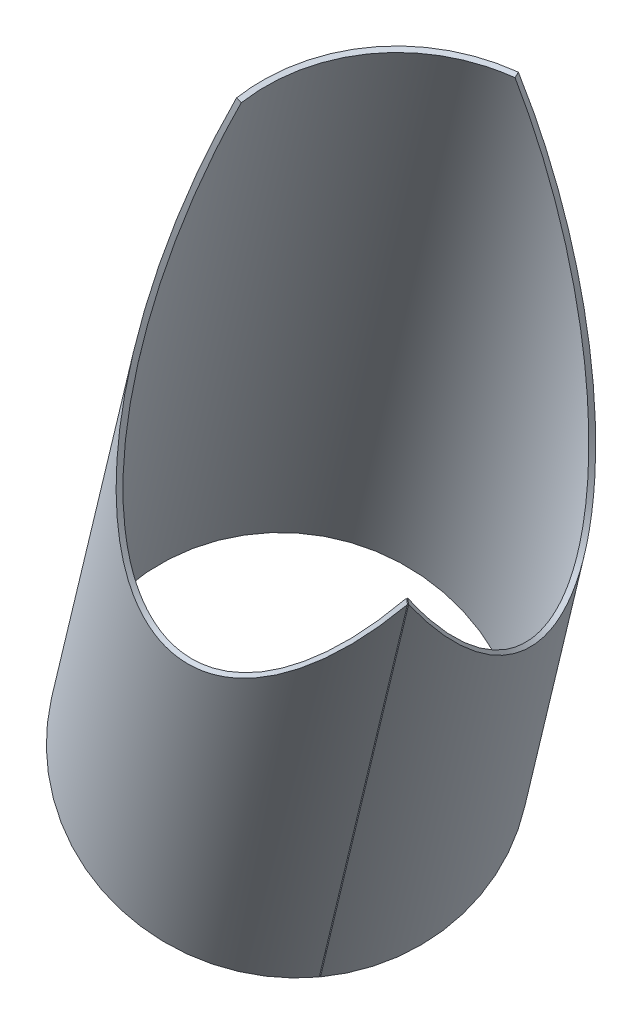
ISO-10303-21;
HEADER;
FILE_DESCRIPTION(('STEP AP214'),'2;1');
FILE_NAME('part.step','',(''),(''),'','','');
FILE_SCHEMA(('AUTOMOTIVE_DESIGN { 1 0 10303 214 1 1 1 1 }'));
ENDSEC;
DATA;
#1=APPLICATION_CONTEXT('core data for automotive mechanical design processes');
#2=APPLICATION_PROTOCOL_DEFINITION('international standard','automotive_design',2000,#1);
#3=PRODUCT_CONTEXT('',#1,'mechanical');
#4=PRODUCT('Part','Part','',(#3));
#5=PRODUCT_RELATED_PRODUCT_CATEGORY('part','',(#4));
#6=PRODUCT_DEFINITION_FORMATION('','',#4);
#7=PRODUCT_DEFINITION_CONTEXT('part definition',#1,'design');
#8=PRODUCT_DEFINITION('design','',#6,#7);
#9=PRODUCT_DEFINITION_SHAPE('','',#8);
#10=(LENGTH_UNIT() NAMED_UNIT(*) SI_UNIT(.MILLI.,.METRE.));
#11=(NAMED_UNIT(*) PLANE_ANGLE_UNIT() SI_UNIT($,.RADIAN.));
#12=(NAMED_UNIT(*) SI_UNIT($,.STERADIAN.) SOLID_ANGLE_UNIT());
#13=UNCERTAINTY_MEASURE_WITH_UNIT(LENGTH_MEASURE(1.E-05),#10,'distance_accuracy_value','');
#14=(GEOMETRIC_REPRESENTATION_CONTEXT(3) GLOBAL_UNCERTAINTY_ASSIGNED_CONTEXT((#13)) GLOBAL_UNIT_ASSIGNED_CONTEXT((#10,
#11,#12)) REPRESENTATION_CONTEXT('',''));
#15=CARTESIAN_POINT('',(0.,0.,0.));
#16=DIRECTION('',(0.,0.,1.));
#17=DIRECTION('',(1.,0.,0.));
#18=AXIS2_PLACEMENT_3D('',#15,#16,#17);
#19=CARTESIAN_POINT('',(-0.850650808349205,-380.940704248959,-2.83800760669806E-12));
#20=CARTESIAN_POINT('',(-3.5742676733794,-384.254979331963,0.000740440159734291));
#21=CARTESIAN_POINT('',(-6.21906750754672,-387.441205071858,0.00036324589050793));
#22=CARTESIAN_POINT('',(-10.0645630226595,-392.031084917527,1.99367438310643E-05));
#23=CARTESIAN_POINT('',(-11.3204493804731,-393.522739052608,2.00070733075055E-06));
#24=CARTESIAN_POINT('',(-13.8270630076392,-396.486040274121,1.46421772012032E-06));
#25=CARTESIAN_POINT('',(-15.0769441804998,-397.956614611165,2.09539954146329E-06));
#26=CARTESIAN_POINT('',(-21.3089049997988,-405.254272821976,4.27006696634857E-06));
#27=CARTESIAN_POINT('',(-26.2382609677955,-410.915363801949,1.49947584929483E-05));
#28=CARTESIAN_POINT('',(-35.9929035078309,-421.905690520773,2.14468695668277E-05));
#29=CARTESIAN_POINT('',(-40.8137847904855,-427.230018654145,-3.05519595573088E-05));
#30=CARTESIAN_POINT('',(-50.3524193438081,-437.558873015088,5.05874269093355E-05));
#31=CARTESIAN_POINT('',(-55.0748777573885,-442.568366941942,0.00018550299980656));
#32=CARTESIAN_POINT('',(-69.092815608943,-457.136611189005,0.00037868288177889));
#33=CARTESIAN_POINT('',(-78.2387481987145,-466.235121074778,6.72825890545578E-05));
#34=CARTESIAN_POINT('',(-96.087166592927,-483.22937703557,-5.31851665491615E-05));
#35=CARTESIAN_POINT('',(-104.816355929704,-491.15109523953,5.56539058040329E-05));
#36=CARTESIAN_POINT('',(-130.409320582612,-513.261587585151,-0.000300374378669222));
#37=CARTESIAN_POINT('',(-146.746196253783,-525.852408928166,6.31746844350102E-06));
#38=CARTESIAN_POINT('',(-170.054544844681,-541.642710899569,0.000306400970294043));
#39=CARTESIAN_POINT('',(-177.622741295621,-546.388981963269,0.000116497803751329));
#40=CARTESIAN_POINT('',(-192.329077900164,-554.862265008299,-0.000119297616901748));
#41=CARTESIAN_POINT('',(-199.46728370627,-558.589544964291,0.000174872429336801));
#42=CARTESIAN_POINT('',(-213.336675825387,-565.066780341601,0.000258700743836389));
#43=CARTESIAN_POINT('',(-220.058414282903,-567.812201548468,-6.20960497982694E-05));
#44=CARTESIAN_POINT('',(-233.076743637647,-572.336344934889,-7.6978604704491E-05));
#45=CARTESIAN_POINT('',(-239.375716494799,-574.115601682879,0.000113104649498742));
#46=CARTESIAN_POINT('',(-257.608302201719,-578.022563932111,4.79704846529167E-05));
#47=CARTESIAN_POINT('',(-268.88508020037,-578.720025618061,0.000192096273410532));
#48=CARTESIAN_POINT('',(-289.573451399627,-576.392325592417,-6.9056147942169E-05));
#49=CARTESIAN_POINT('',(-298.97668760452,-573.36895871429,-9.73714627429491E-06));
#50=CARTESIAN_POINT('',(-315.822313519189,-563.671426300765,4.90719510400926E-05));
#51=CARTESIAN_POINT('',(-323.260171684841,-556.999321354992,-4.7249992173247E-05));
#52=CARTESIAN_POINT('',(-336.054932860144,-540.040323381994,2.37794321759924E-05));
#53=CARTESIAN_POINT('',(-341.413955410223,-529.748481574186,0.000254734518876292));
#54=CARTESIAN_POINT('',(-347.783574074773,-511.605367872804,0.000113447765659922));
#55=CARTESIAN_POINT('',(-349.627050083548,-505.112417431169,-6.04285640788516E-05));
#56=CARTESIAN_POINT('',(-352.739084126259,-491.215181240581,3.53721247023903E-05));
#57=CARTESIAN_POINT('',(-354.007156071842,-483.812538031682,4.51450949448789E-05));
#58=CARTESIAN_POINT('',(-355.943088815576,-468.112270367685,3.2893340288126E-05));
#59=CARTESIAN_POINT('',(-356.612074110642,-459.804189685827,0.000185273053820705));
#60=CARTESIAN_POINT('',(-357.326455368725,-442.276652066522,2.69761260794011E-05));
#61=CARTESIAN_POINT('',(-357.37190526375,-433.058922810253,-3.73405925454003E-05));
#62=CARTESIAN_POINT('',(-356.809014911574,-413.676073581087,3.49055731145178E-05));
#63=CARTESIAN_POINT('',(-356.201393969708,-403.522697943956,-5.74588035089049E-05));
#64=CARTESIAN_POINT('',(-354.294816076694,-382.239659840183,7.53471837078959E-05));
#65=CARTESIAN_POINT('',(-352.997615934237,-371.123312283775,-0.000103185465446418));
#66=CARTESIAN_POINT('',(-349.664656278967,-347.871927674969,0.000243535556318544));
#67=CARTESIAN_POINT('',(-347.629857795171,-335.744689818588,0.00021140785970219));
#68=CARTESIAN_POINT('',(-343.994875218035,-316.817834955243,-5.23124828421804E-07));
#69=CARTESIAN_POINT('',(-342.687074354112,-310.390721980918,-1.12350357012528E-05));
#70=CARTESIAN_POINT('',(-339.86348243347,-297.25481620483,0.000163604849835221));
#71=CARTESIAN_POINT('',(-338.348332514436,-290.549547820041,0.000270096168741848));
#72=CARTESIAN_POINT('',(-335.104765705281,-276.86781054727,0.000292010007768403));
#73=CARTESIAN_POINT('',(-333.376348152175,-269.891341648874,0.000206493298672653));
#74=CARTESIAN_POINT('',(-329.699551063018,-255.670864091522,1.86023203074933E-05));
#75=CARTESIAN_POINT('',(-327.753568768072,-248.435264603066,-2.12572615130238E-05));
#76=CARTESIAN_POINT('',(-321.550393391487,-226.244048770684,0.000252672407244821));
#77=CARTESIAN_POINT('',(-316.931036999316,-210.817086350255,0.000194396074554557));
#78=CARTESIAN_POINT('',(-310.505362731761,-190.767435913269,9.1078316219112E-07));
#79=CARTESIAN_POINT('',(-309.188811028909,-186.722704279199,-8.34801608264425E-06));
#80=CARTESIAN_POINT('',(-306.480706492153,-178.531397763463,7.16863416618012E-05));
#81=CARTESIAN_POINT('',(-305.089686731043,-174.386568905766,0.000140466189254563));
#82=CARTESIAN_POINT('',(-300.803152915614,-161.805880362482,0.00029089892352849));
#83=CARTESIAN_POINT('',(-297.794178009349,-153.223798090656,0.000282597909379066));
#84=CARTESIAN_POINT('',(-293.043237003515,-140.063906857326,0.000121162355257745));
#85=CARTESIAN_POINT('',(-291.420006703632,-135.629486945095,5.08441900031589E-05));
#86=CARTESIAN_POINT('',(-288.092581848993,-126.666074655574,-1.549480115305E-05));
#87=CARTESIAN_POINT('',(-286.388475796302,-122.137085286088,1.87677735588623E-05));
#88=CARTESIAN_POINT('',(-281.118407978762,-108.323112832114,0.000236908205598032));
#89=CARTESIAN_POINT('',(-277.405466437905,-98.8401600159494,0.000377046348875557));
#90=CARTESIAN_POINT('',(-271.519002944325,-84.2146399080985,0.000229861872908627));
#91=CARTESIAN_POINT('',(-269.503997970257,-79.2726286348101,0.000136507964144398));
#92=CARTESIAN_POINT('',(-265.365239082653,-69.25662001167,-1.41058476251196E-07));
#93=CARTESIAN_POINT('',(-263.247342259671,-64.1961449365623,-1.4967792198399E-05));
#94=CARTESIAN_POINT('',(-256.645751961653,-48.6322433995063,0.000273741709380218));
#95=CARTESIAN_POINT('',(-251.933280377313,-37.7934344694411,0.000488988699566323));
#96=CARTESIAN_POINT('',(-244.361021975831,-20.860211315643,0.000205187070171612));
#97=CARTESIAN_POINT('',(-241.75298213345,-15.1033312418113,4.52690636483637E-05));
#98=CARTESIAN_POINT('',(-238.383993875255,-7.76887662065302,-2.04042135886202E-06));
#99=CARTESIAN_POINT('',(-237.706006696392,-6.2977657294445,-4.56912471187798E-06));
#100=CARTESIAN_POINT('',(-236.324863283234,-3.31122257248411,4.59025045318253E-05));
#101=CARTESIAN_POINT('',(-235.62320342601,-1.79906331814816,9.22085759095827E-05));
#102=CARTESIAN_POINT('',(-233.484528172,2.793858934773,0.000261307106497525));
#103=CARTESIAN_POINT('',(-232.013820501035,5.93106901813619,0.000412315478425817));
#104=CARTESIAN_POINT('',(-224.429705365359,21.9903617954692,0.00102790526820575));
#105=CARTESIAN_POINT('',(-217.625659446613,36.0329355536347,0.000219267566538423));
#106=CARTESIAN_POINT('',(-210.000000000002,51.2248383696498,-3.00773945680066E-12));
#107=CARTESIAN_POINT('',(-4.88732738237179,-377.62408885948,-2.95047531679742));
#108=CARTESIAN_POINT('',(-7.58397536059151,-380.938424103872,-2.98669983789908));
#109=CARTESIAN_POINT('',(-10.2022491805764,-384.124997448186,-3.02269564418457));
#110=CARTESIAN_POINT('',(-14.0087192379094,-388.715755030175,-3.07450166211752));
#111=CARTESIAN_POINT('',(-15.2517818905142,-390.207759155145,-3.0912722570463));
#112=CARTESIAN_POINT('',(-17.7326528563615,-393.171879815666,-3.12460282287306));
#113=CARTESIAN_POINT('',(-18.9696230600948,-394.642924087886,-3.14116732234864));
#114=CARTESIAN_POINT('',(-25.1368398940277,-401.943228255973,-3.22349122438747));
#115=CARTESIAN_POINT('',(-30.0138005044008,-407.607382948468,-3.28773868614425));
#116=CARTESIAN_POINT('',(-39.662497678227,-418.6056262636,-3.41324896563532));
#117=CARTESIAN_POINT('',(-44.4298775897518,-423.934803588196,-3.47450203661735));
#118=CARTESIAN_POINT('',(-53.8604607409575,-434.275048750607,-3.59392566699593));
#119=CARTESIAN_POINT('',(-58.5283144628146,-439.29109100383,-3.65215245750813));
#120=CARTESIAN_POINT('',(-72.3809544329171,-453.881408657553,-3.82285822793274));
#121=CARTESIAN_POINT('',(-81.4147131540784,-462.997872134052,-3.93151618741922));
#122=CARTESIAN_POINT('',(-99.0361111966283,-480.033810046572,-4.13719713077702));
#123=CARTESIAN_POINT('',(-107.650120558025,-487.979314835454,-4.23461188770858));
#124=CARTESIAN_POINT('',(-132.893520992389,-510.169286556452,-4.51225239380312));
#125=CARTESIAN_POINT('',(-148.991038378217,-522.82413486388,-4.67717720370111));
#126=CARTESIAN_POINT('',(-171.934745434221,-538.724761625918,-4.89580115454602));
#127=CARTESIAN_POINT('',(-179.380489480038,-543.510181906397,-4.96412208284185));
#128=CARTESIAN_POINT('',(-193.840897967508,-552.066081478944,-5.09095330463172));
#129=CARTESIAN_POINT('',(-200.855628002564,-555.836824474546,-5.14913457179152));
#130=CARTESIAN_POINT('',(-214.47696790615,-562.405188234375,-5.25673846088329));
#131=CARTESIAN_POINT('',(-221.074298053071,-565.198214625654,-5.30619441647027));
#132=CARTESIAN_POINT('',(-233.843232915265,-569.821476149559,-5.39525230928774));
#133=CARTESIAN_POINT('',(-240.017171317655,-571.652267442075,-5.43498114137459));
#134=CARTESIAN_POINT('',(-257.874606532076,-575.719255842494,-5.54096016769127));
#135=CARTESIAN_POINT('',(-268.901051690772,-576.530698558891,-5.59303009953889));
#136=CARTESIAN_POINT('',(-289.091755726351,-574.443604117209,-5.66116404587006));
#137=CARTESIAN_POINT('',(-298.247865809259,-571.546753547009,-5.6767545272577));
#138=CARTESIAN_POINT('',(-314.605187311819,-562.113247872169,-5.67161100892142));
#139=CARTESIAN_POINT('',(-321.801993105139,-555.578587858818,-5.65096750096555));
#140=CARTESIAN_POINT('',(-334.123724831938,-538.903878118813,-5.57282072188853));
#141=CARTESIAN_POINT('',(-339.250668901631,-528.758944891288,-5.51522598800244));
#142=CARTESIAN_POINT('',(-345.281513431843,-510.842045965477,-5.40145224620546));
#143=CARTESIAN_POINT('',(-347.013718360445,-504.425410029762,-5.35904551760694));
#144=CARTESIAN_POINT('',(-349.90664599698,-490.682634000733,-5.26436304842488));
#145=CARTESIAN_POINT('',(-351.066912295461,-483.358118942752,-5.21235125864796));
#146=CARTESIAN_POINT('',(-352.791423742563,-467.81553032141,-5.09894338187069));
#147=CARTESIAN_POINT('',(-353.356655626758,-459.587102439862,-5.03730112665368));
#148=CARTESIAN_POINT('',(-353.868081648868,-442.22019070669,-4.90482867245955));
#149=CARTESIAN_POINT('',(-353.814345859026,-433.083418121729,-4.83377199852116));
#150=CARTESIAN_POINT('',(-353.057939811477,-413.863790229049,-4.68141975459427));
#151=CARTESIAN_POINT('',(-352.356098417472,-403.792586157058,-4.60044110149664));
#152=CARTESIAN_POINT('',(-350.266485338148,-382.675050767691,-4.42775181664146));
#153=CARTESIAN_POINT('',(-348.880573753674,-371.641939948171,-4.33654486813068));
#154=CARTESIAN_POINT('',(-345.376223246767,-348.558052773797,-4.14249854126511));
#155=CARTESIAN_POINT('',(-343.258808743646,-336.515022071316,-4.04026662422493));
#156=CARTESIAN_POINT('',(-339.505387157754,-317.714699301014,-3.87896525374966));
#157=CARTESIAN_POINT('',(-338.159045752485,-311.329771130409,-3.8238265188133));
#158=CARTESIAN_POINT('',(-335.260126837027,-298.278477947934,-3.71031527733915));
#159=CARTESIAN_POINT('',(-333.708213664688,-291.615614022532,-3.65204973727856));
#160=CARTESIAN_POINT('',(-330.39310823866,-278.01878397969,-3.53272148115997));
#161=CARTESIAN_POINT('',(-328.629915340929,-271.084817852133,-3.47165967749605));
#162=CARTESIAN_POINT('',(-324.885746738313,-256.949339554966,-3.34656966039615));
#163=CARTESIAN_POINT('',(-322.90720275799,-249.756188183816,-3.28255553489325));
#164=CARTESIAN_POINT('',(-316.609530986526,-227.692653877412,-3.08486604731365));
#165=CARTESIAN_POINT('',(-311.93150084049,-212.351186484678,-2.94640342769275));
#166=CARTESIAN_POINT('',(-305.439220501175,-192.408155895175,-2.76481279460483));
#167=CARTESIAN_POINT('',(-304.109695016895,-188.384717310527,-2.72806633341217));
#168=CARTESIAN_POINT('',(-301.376272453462,-180.236086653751,-2.65337815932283));
#169=CARTESIAN_POINT('',(-299.972914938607,-176.112631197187,-2.61547215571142));
#170=CARTESIAN_POINT('',(-295.650405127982,-163.596131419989,-2.50020652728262));
#171=CARTESIAN_POINT('',(-292.618828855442,-155.056933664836,-2.42133235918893));
#172=CARTESIAN_POINT('',(-287.836361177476,-141.961345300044,-2.29996198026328));
#173=CARTESIAN_POINT('',(-286.203017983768,-137.548355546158,-2.25898724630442));
#174=CARTESIAN_POINT('',(-282.856210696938,-128.627766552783,-2.17589765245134));
#175=CARTESIAN_POINT('',(-281.142832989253,-124.120171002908,-2.1337536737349));
#176=CARTESIAN_POINT('',(-275.846138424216,-110.370681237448,-2.00479834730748));
#177=CARTESIAN_POINT('',(-272.117093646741,-100.93098094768,-1.91588795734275));
#178=CARTESIAN_POINT('',(-266.20945309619,-86.3704681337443,-1.77845158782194));
#179=CARTESIAN_POINT('',(-264.187885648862,-81.4501470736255,-1.73194616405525));
#180=CARTESIAN_POINT('',(-260.037081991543,-71.4775128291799,-1.63741403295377));
#181=CARTESIAN_POINT('',(-257.913712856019,-66.4386660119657,-1.58948850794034));
#182=CARTESIAN_POINT('',(-251.297298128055,-50.9403462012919,-1.44139929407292));
#183=CARTESIAN_POINT('',(-246.577133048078,-40.1459834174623,-1.33777737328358));
#184=CARTESIAN_POINT('',(-238.997659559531,-23.2799654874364,-1.17562334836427));
#185=CARTESIAN_POINT('',(-236.387936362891,-17.5455756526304,-1.12041704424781));
#186=CARTESIAN_POINT('',(-233.017860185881,-10.2392805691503,-1.04973791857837));
#187=CARTESIAN_POINT('',(-232.339706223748,-8.77379376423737,-1.035545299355));
#188=CARTESIAN_POINT('',(-230.958332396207,-5.79861729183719,-1.00665859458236));
#189=CARTESIAN_POINT('',(-230.256609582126,-4.29218804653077,-0.992002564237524));
#190=CARTESIAN_POINT('',(-228.117914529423,0.283410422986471,-0.947428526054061));
#191=CARTESIAN_POINT('',(-226.64741899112,3.40889290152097,-0.916906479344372));
#192=CARTESIAN_POINT('',(-219.06566134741,19.4087432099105,-0.760587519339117));
#193=CARTESIAN_POINT('',(-212.267618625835,33.4011700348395,-0.624496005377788));
#194=CARTESIAN_POINT('',(-204.654508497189,48.541632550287,-0.475528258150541));
#195=B_SPLINE_SURFACE_WITH_KNOTS('',1,3,((#19,#20,#21,#22,#23,#24,#25,#26,#27,#28,#29,#30,#31,
#32,#33,#34,#35,#36,#37,#38,#39,#40,#41,#42,#43,#44,#45,#46,#47,#48,#49,#50,#51,#52,#53,#54,#55,
#56,#57,#58,#59,#60,#61,#62,#63,#64,#65,#66,#67,#68,#69,#70,#71,#72,#73,#74,#75,#76,#77,#78,#79,
#80,#81,#82,#83,#84,#85,#86,#87,#88,#89,#90,#91,#92,#93,#94,#95,#96,#97,#98,#99,#100,#101,#102,
#103,#104,#105,#106),(#107,#108,#109,#110,#111,#112,#113,#114,#115,#116,#117,#118,#119,#120,
#121,#122,#123,#124,#125,#126,#127,#128,#129,#130,#131,#132,#133,#134,#135,#136,#137,#138,#139,
#140,#141,#142,#143,#144,#145,#146,#147,#148,#149,#150,#151,#152,#153,#154,#155,#156,#157,#158,
#159,#160,#161,#162,#163,#164,#165,#166,#167,#168,#169,#170,#171,#172,#173,#174,#175,#176,#177,
#178,#179,#180,#181,#182,#183,#184,#185,#186,#187,#188,#189,#190,#191,#192,#193,#194)),
.UNSPECIFIED.,.F.,.F.,.F.,(2,2),(4,2,2,2,2,2,2,2,2,2,2,2,2,2,2,2,2,2,2,2,2,2,2,2,2,2,2,2,2,2,2,
2,2,2,2,2,2,2,2,2,2,2,2,4),(0.,1.),(0.,0.0078125,0.01171875,0.015625,0.03125,0.046875,0.0625,
0.09375,0.125,0.1875,0.21875,0.25,0.28125,0.3125,0.375,0.4375,0.5,0.5625,0.59375,0.625,0.65625,
0.6875,0.71875,0.75,0.78125,0.796875,0.8125,0.828125,0.84375,0.875,0.8828125,0.890625,0.90625,
0.9140625,0.921875,0.9375,0.9453125,0.953125,0.96875,0.9765625,0.978515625,0.98046875,0.984375,
1.),.UNSPECIFIED.);
#196=CARTESIAN_POINT('',(-0.850650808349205,-380.940704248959,-2.83800760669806E-12));
#197=CARTESIAN_POINT('',(-4.88732738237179,-377.62408885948,-2.95047531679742));
#198=B_SPLINE_CURVE_WITH_KNOTS('',1,(#196,#197),.UNSPECIFIED.,.F.,.F.,(2,2),(0.,1.),.UNSPECIFIED.);
#199=CARTESIAN_POINT('',(-4.88732738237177,-377.62408885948,-2.9504753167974));
#200=VERTEX_POINT('',#199);
#201=CARTESIAN_POINT('',(-0.850650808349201,-380.940704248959,-2.84494650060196E-12));
#202=VERTEX_POINT('',#201);
#203=EDGE_CURVE('E13',#200,#202,#198,.F.);
#204=CARTESIAN_POINT('',(-4.88732738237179,-377.62408885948,-2.95047531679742));
#205=CARTESIAN_POINT('',(-7.58397536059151,-380.938424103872,-2.98669983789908));
#206=CARTESIAN_POINT('',(-10.2022491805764,-384.124997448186,-3.02269564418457));
#207=CARTESIAN_POINT('',(-14.0087192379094,-388.715755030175,-3.07450166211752));
#208=CARTESIAN_POINT('',(-15.2517818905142,-390.207759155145,-3.0912722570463));
#209=CARTESIAN_POINT('',(-17.7326528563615,-393.171879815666,-3.12460282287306));
#210=CARTESIAN_POINT('',(-18.9696230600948,-394.642924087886,-3.14116732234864));
#211=CARTESIAN_POINT('',(-25.1368398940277,-401.943228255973,-3.22349122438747));
#212=CARTESIAN_POINT('',(-30.0138005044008,-407.607382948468,-3.28773868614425));
#213=CARTESIAN_POINT('',(-39.662497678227,-418.6056262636,-3.41324896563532));
#214=CARTESIAN_POINT('',(-44.4298775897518,-423.934803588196,-3.47450203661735));
#215=CARTESIAN_POINT('',(-53.8604607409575,-434.275048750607,-3.59392566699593));
#216=CARTESIAN_POINT('',(-58.5283144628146,-439.29109100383,-3.65215245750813));
#217=CARTESIAN_POINT('',(-72.3809544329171,-453.881408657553,-3.82285822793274));
#218=CARTESIAN_POINT('',(-81.4147131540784,-462.997872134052,-3.93151618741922));
#219=CARTESIAN_POINT('',(-99.0361111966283,-480.033810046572,-4.13719713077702));
#220=CARTESIAN_POINT('',(-107.650120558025,-487.979314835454,-4.23461188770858));
#221=CARTESIAN_POINT('',(-132.893520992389,-510.169286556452,-4.51225239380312));
#222=CARTESIAN_POINT('',(-148.991038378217,-522.82413486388,-4.67717720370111));
#223=CARTESIAN_POINT('',(-171.934745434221,-538.724761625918,-4.89580115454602));
#224=CARTESIAN_POINT('',(-179.380489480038,-543.510181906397,-4.96412208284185));
#225=CARTESIAN_POINT('',(-193.840897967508,-552.066081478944,-5.09095330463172));
#226=CARTESIAN_POINT('',(-200.855628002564,-555.836824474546,-5.14913457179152));
#227=CARTESIAN_POINT('',(-214.47696790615,-562.405188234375,-5.25673846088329));
#228=CARTESIAN_POINT('',(-221.074298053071,-565.198214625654,-5.30619441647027));
#229=CARTESIAN_POINT('',(-233.843232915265,-569.821476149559,-5.39525230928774));
#230=CARTESIAN_POINT('',(-240.017171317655,-571.652267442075,-5.43498114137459));
#231=CARTESIAN_POINT('',(-257.874606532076,-575.719255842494,-5.54096016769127));
#232=CARTESIAN_POINT('',(-268.901051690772,-576.530698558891,-5.59303009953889));
#233=CARTESIAN_POINT('',(-289.091755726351,-574.443604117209,-5.66116404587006));
#234=CARTESIAN_POINT('',(-298.247865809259,-571.546753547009,-5.6767545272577));
#235=CARTESIAN_POINT('',(-314.605187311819,-562.113247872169,-5.67161100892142));
#236=CARTESIAN_POINT('',(-321.801993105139,-555.578587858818,-5.65096750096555));
#237=CARTESIAN_POINT('',(-334.123724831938,-538.903878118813,-5.57282072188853));
#238=CARTESIAN_POINT('',(-339.250668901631,-528.758944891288,-5.51522598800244));
#239=CARTESIAN_POINT('',(-345.281513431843,-510.842045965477,-5.40145224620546));
#240=CARTESIAN_POINT('',(-347.013718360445,-504.425410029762,-5.35904551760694));
#241=CARTESIAN_POINT('',(-349.90664599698,-490.682634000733,-5.26436304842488));
#242=CARTESIAN_POINT('',(-351.066912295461,-483.358118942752,-5.21235125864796));
#243=CARTESIAN_POINT('',(-352.791423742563,-467.81553032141,-5.09894338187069));
#244=CARTESIAN_POINT('',(-353.356655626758,-459.587102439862,-5.03730112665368));
#245=CARTESIAN_POINT('',(-353.868081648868,-442.22019070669,-4.90482867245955));
#246=CARTESIAN_POINT('',(-353.814345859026,-433.083418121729,-4.83377199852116));
#247=CARTESIAN_POINT('',(-353.057939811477,-413.863790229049,-4.68141975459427));
#248=CARTESIAN_POINT('',(-352.356098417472,-403.792586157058,-4.60044110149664));
#249=CARTESIAN_POINT('',(-350.266485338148,-382.675050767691,-4.42775181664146));
#250=CARTESIAN_POINT('',(-348.880573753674,-371.641939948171,-4.33654486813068));
#251=CARTESIAN_POINT('',(-345.376223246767,-348.558052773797,-4.14249854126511));
#252=CARTESIAN_POINT('',(-343.258808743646,-336.515022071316,-4.04026662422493));
#253=CARTESIAN_POINT('',(-339.505387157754,-317.714699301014,-3.87896525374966));
#254=CARTESIAN_POINT('',(-338.159045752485,-311.329771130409,-3.8238265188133));
#255=CARTESIAN_POINT('',(-335.260126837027,-298.278477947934,-3.71031527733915));
#256=CARTESIAN_POINT('',(-333.708213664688,-291.615614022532,-3.65204973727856));
#257=CARTESIAN_POINT('',(-330.39310823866,-278.01878397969,-3.53272148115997));
#258=CARTESIAN_POINT('',(-328.629915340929,-271.084817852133,-3.47165967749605));
#259=CARTESIAN_POINT('',(-324.885746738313,-256.949339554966,-3.34656966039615));
#260=CARTESIAN_POINT('',(-322.90720275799,-249.756188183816,-3.28255553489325));
#261=CARTESIAN_POINT('',(-316.609530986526,-227.692653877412,-3.08486604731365));
#262=CARTESIAN_POINT('',(-311.93150084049,-212.351186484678,-2.94640342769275));
#263=CARTESIAN_POINT('',(-305.439220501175,-192.408155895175,-2.76481279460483));
#264=CARTESIAN_POINT('',(-304.109695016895,-188.384717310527,-2.72806633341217));
#265=CARTESIAN_POINT('',(-301.376272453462,-180.236086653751,-2.65337815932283));
#266=CARTESIAN_POINT('',(-299.972914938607,-176.112631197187,-2.61547215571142));
#267=CARTESIAN_POINT('',(-295.650405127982,-163.596131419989,-2.50020652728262));
#268=CARTESIAN_POINT('',(-292.618828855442,-155.056933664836,-2.42133235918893));
#269=CARTESIAN_POINT('',(-287.836361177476,-141.961345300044,-2.29996198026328));
#270=CARTESIAN_POINT('',(-286.203017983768,-137.548355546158,-2.25898724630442));
#271=CARTESIAN_POINT('',(-282.856210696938,-128.627766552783,-2.17589765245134));
#272=CARTESIAN_POINT('',(-281.142832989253,-124.120171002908,-2.1337536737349));
#273=CARTESIAN_POINT('',(-275.846138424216,-110.370681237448,-2.00479834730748));
#274=CARTESIAN_POINT('',(-272.117093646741,-100.93098094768,-1.91588795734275));
#275=CARTESIAN_POINT('',(-266.20945309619,-86.3704681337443,-1.77845158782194));
#276=CARTESIAN_POINT('',(-264.187885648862,-81.4501470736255,-1.73194616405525));
#277=CARTESIAN_POINT('',(-260.037081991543,-71.4775128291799,-1.63741403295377));
#278=CARTESIAN_POINT('',(-257.913712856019,-66.4386660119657,-1.58948850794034));
#279=CARTESIAN_POINT('',(-251.297298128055,-50.9403462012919,-1.44139929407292));
#280=CARTESIAN_POINT('',(-246.577133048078,-40.1459834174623,-1.33777737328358));
#281=CARTESIAN_POINT('',(-238.997659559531,-23.2799654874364,-1.17562334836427));
#282=CARTESIAN_POINT('',(-236.387936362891,-17.5455756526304,-1.12041704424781));
#283=CARTESIAN_POINT('',(-233.017860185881,-10.2392805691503,-1.04973791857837));
#284=CARTESIAN_POINT('',(-232.339706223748,-8.77379376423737,-1.035545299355));
#285=CARTESIAN_POINT('',(-230.958332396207,-5.79861729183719,-1.00665859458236));
#286=CARTESIAN_POINT('',(-230.256609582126,-4.29218804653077,-0.992002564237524));
#287=CARTESIAN_POINT('',(-228.117914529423,0.283410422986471,-0.947428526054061));
#288=CARTESIAN_POINT('',(-226.64741899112,3.40889290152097,-0.916906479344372));
#289=CARTESIAN_POINT('',(-219.06566134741,19.4087432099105,-0.760587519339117));
#290=CARTESIAN_POINT('',(-212.267618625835,33.4011700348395,-0.624496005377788));
#291=CARTESIAN_POINT('',(-204.654508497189,48.541632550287,-0.475528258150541));
#292=B_SPLINE_CURVE_WITH_KNOTS('',3,(#204,#205,#206,#207,#208,#209,#210,#211,#212,#213,#214,
#215,#216,#217,#218,#219,#220,#221,#222,#223,#224,#225,#226,#227,#228,#229,#230,#231,#232,#233,
#234,#235,#236,#237,#238,#239,#240,#241,#242,#243,#244,#245,#246,#247,#248,#249,#250,#251,#252,
#253,#254,#255,#256,#257,#258,#259,#260,#261,#262,#263,#264,#265,#266,#267,#268,#269,#270,#271,
#272,#273,#274,#275,#276,#277,#278,#279,#280,#281,#282,#283,#284,#285,#286,#287,#288,#289,#290,
#291),.UNSPECIFIED.,.F.,.F.,(4,2,2,2,2,2,2,2,2,2,2,2,2,2,2,2,2,2,2,2,2,2,2,2,2,2,2,2,2,2,2,2,2,
2,2,2,2,2,2,2,2,2,2,4),(0.,0.0078125,0.01171875,0.015625,0.03125,0.046875,0.0625,0.09375,0.125,
0.1875,0.21875,0.25,0.28125,0.3125,0.375,0.4375,0.5,0.5625,0.59375,0.625,0.65625,0.6875,0.71875,
0.75,0.78125,0.796875,0.8125,0.828125,0.84375,0.875,0.8828125,0.890625,0.90625,0.9140625,
0.921875,0.9375,0.9453125,0.953125,0.96875,0.9765625,0.978515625,0.98046875,0.984375,1.),.UNSPECIFIED.);
#293=CARTESIAN_POINT('',(-204.654508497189,48.541632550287,-0.475528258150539));
#294=VERTEX_POINT('',#293);
#295=EDGE_CURVE('E104',#200,#294,#292,.T.);
#296=CARTESIAN_POINT('',(-204.654508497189,48.541632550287,-0.475528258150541));
#297=CARTESIAN_POINT('',(-210.000000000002,51.2248383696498,-3.00773945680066E-12));
#298=B_SPLINE_CURVE_WITH_KNOTS('',1,(#296,#297),.UNSPECIFIED.,.F.,.F.,(2,2),(0.,1.),.UNSPECIFIED.);
#299=CARTESIAN_POINT('',(-210.000000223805,51.224837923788,3.41393580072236E-12));
#300=VERTEX_POINT('',#299);
#301=EDGE_CURVE('E51',#294,#300,#298,.T.);
#302=CARTESIAN_POINT('',(-210.000000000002,51.2248383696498,-3.00773945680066E-12));
#303=CARTESIAN_POINT('',(-217.625659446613,36.0329355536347,0.000219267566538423));
#304=CARTESIAN_POINT('',(-224.429705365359,21.9903617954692,0.00102790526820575));
#305=CARTESIAN_POINT('',(-232.013820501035,5.93106901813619,0.000412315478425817));
#306=CARTESIAN_POINT('',(-233.484528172,2.793858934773,0.000261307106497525));
#307=CARTESIAN_POINT('',(-235.62320342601,-1.79906331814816,9.22085759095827E-05));
#308=CARTESIAN_POINT('',(-236.324863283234,-3.31122257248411,4.59025045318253E-05));
#309=CARTESIAN_POINT('',(-237.706006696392,-6.2977657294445,-4.56912471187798E-06));
#310=CARTESIAN_POINT('',(-238.383993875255,-7.76887662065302,-2.04042135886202E-06));
#311=CARTESIAN_POINT('',(-241.75298213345,-15.1033312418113,4.52690636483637E-05));
#312=CARTESIAN_POINT('',(-244.361021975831,-20.860211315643,0.000205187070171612));
#313=CARTESIAN_POINT('',(-251.933280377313,-37.7934344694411,0.000488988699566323));
#314=CARTESIAN_POINT('',(-256.645751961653,-48.6322433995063,0.000273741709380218));
#315=CARTESIAN_POINT('',(-263.247342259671,-64.1961449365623,-1.4967792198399E-05));
#316=CARTESIAN_POINT('',(-265.365239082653,-69.25662001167,-1.41058476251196E-07));
#317=CARTESIAN_POINT('',(-269.503997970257,-79.2726286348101,0.000136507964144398));
#318=CARTESIAN_POINT('',(-271.519002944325,-84.2146399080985,0.000229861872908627));
#319=CARTESIAN_POINT('',(-277.405466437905,-98.8401600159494,0.000377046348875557));
#320=CARTESIAN_POINT('',(-281.118407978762,-108.323112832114,0.000236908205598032));
#321=CARTESIAN_POINT('',(-286.388475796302,-122.137085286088,1.87677735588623E-05));
#322=CARTESIAN_POINT('',(-288.092581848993,-126.666074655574,-1.549480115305E-05));
#323=CARTESIAN_POINT('',(-291.420006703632,-135.629486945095,5.08441900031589E-05));
#324=CARTESIAN_POINT('',(-293.043237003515,-140.063906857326,0.000121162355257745));
#325=CARTESIAN_POINT('',(-297.794178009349,-153.223798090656,0.000282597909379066));
#326=CARTESIAN_POINT('',(-300.803152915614,-161.805880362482,0.00029089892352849));
#327=CARTESIAN_POINT('',(-305.089686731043,-174.386568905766,0.000140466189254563));
#328=CARTESIAN_POINT('',(-306.480706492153,-178.531397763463,7.16863416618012E-05));
#329=CARTESIAN_POINT('',(-309.188811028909,-186.722704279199,-8.34801608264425E-06));
#330=CARTESIAN_POINT('',(-310.505362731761,-190.767435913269,9.1078316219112E-07));
#331=CARTESIAN_POINT('',(-316.931036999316,-210.817086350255,0.000194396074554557));
#332=CARTESIAN_POINT('',(-321.550393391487,-226.244048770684,0.000252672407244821));
#333=CARTESIAN_POINT('',(-327.753568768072,-248.435264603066,-2.12572615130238E-05));
#334=CARTESIAN_POINT('',(-329.699551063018,-255.670864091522,1.86023203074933E-05));
#335=CARTESIAN_POINT('',(-333.376348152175,-269.891341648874,0.000206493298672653));
#336=CARTESIAN_POINT('',(-335.104765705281,-276.86781054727,0.000292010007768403));
#337=CARTESIAN_POINT('',(-338.348332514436,-290.549547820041,0.000270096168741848));
#338=CARTESIAN_POINT('',(-339.86348243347,-297.25481620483,0.000163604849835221));
#339=CARTESIAN_POINT('',(-342.687074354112,-310.390721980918,-1.12350357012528E-05));
#340=CARTESIAN_POINT('',(-343.994875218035,-316.817834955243,-5.23124828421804E-07));
#341=CARTESIAN_POINT('',(-347.629857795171,-335.744689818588,0.00021140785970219));
#342=CARTESIAN_POINT('',(-349.664656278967,-347.871927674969,0.000243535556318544));
#343=CARTESIAN_POINT('',(-352.997615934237,-371.123312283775,-0.000103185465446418));
#344=CARTESIAN_POINT('',(-354.294816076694,-382.239659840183,7.53471837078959E-05));
#345=CARTESIAN_POINT('',(-356.201393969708,-403.522697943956,-5.74588035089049E-05));
#346=CARTESIAN_POINT('',(-356.809014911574,-413.676073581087,3.49055731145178E-05));
#347=CARTESIAN_POINT('',(-357.37190526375,-433.058922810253,-3.73405925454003E-05));
#348=CARTESIAN_POINT('',(-357.326455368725,-442.276652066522,2.69761260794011E-05));
#349=CARTESIAN_POINT('',(-356.612074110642,-459.804189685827,0.000185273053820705));
#350=CARTESIAN_POINT('',(-355.943088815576,-468.112270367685,3.2893340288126E-05));
#351=CARTESIAN_POINT('',(-354.007156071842,-483.812538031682,4.51450949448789E-05));
#352=CARTESIAN_POINT('',(-352.739084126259,-491.215181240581,3.53721247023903E-05));
#353=CARTESIAN_POINT('',(-349.627050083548,-505.112417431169,-6.04285640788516E-05));
#354=CARTESIAN_POINT('',(-347.783574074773,-511.605367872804,0.000113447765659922));
#355=CARTESIAN_POINT('',(-341.413955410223,-529.748481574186,0.000254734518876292));
#356=CARTESIAN_POINT('',(-336.054932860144,-540.040323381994,2.37794321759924E-05));
#357=CARTESIAN_POINT('',(-323.260171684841,-556.999321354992,-4.7249992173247E-05));
#358=CARTESIAN_POINT('',(-315.822313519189,-563.671426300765,4.90719510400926E-05));
#359=CARTESIAN_POINT('',(-298.97668760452,-573.36895871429,-9.73714627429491E-06));
#360=CARTESIAN_POINT('',(-289.573451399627,-576.392325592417,-6.9056147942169E-05));
#361=CARTESIAN_POINT('',(-268.88508020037,-578.720025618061,0.000192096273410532));
#362=CARTESIAN_POINT('',(-257.608302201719,-578.022563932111,4.79704846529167E-05));
#363=CARTESIAN_POINT('',(-239.375716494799,-574.115601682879,0.000113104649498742));
#364=CARTESIAN_POINT('',(-233.076743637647,-572.336344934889,-7.6978604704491E-05));
#365=CARTESIAN_POINT('',(-220.058414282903,-567.812201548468,-6.20960497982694E-05));
#366=CARTESIAN_POINT('',(-213.336675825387,-565.066780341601,0.000258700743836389));
#367=CARTESIAN_POINT('',(-199.46728370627,-558.589544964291,0.000174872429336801));
#368=CARTESIAN_POINT('',(-192.329077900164,-554.862265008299,-0.000119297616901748));
#369=CARTESIAN_POINT('',(-177.622741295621,-546.388981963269,0.000116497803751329));
#370=CARTESIAN_POINT('',(-170.054544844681,-541.642710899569,0.000306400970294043));
#371=CARTESIAN_POINT('',(-146.746196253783,-525.852408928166,6.31746844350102E-06));
#372=CARTESIAN_POINT('',(-130.409320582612,-513.261587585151,-0.000300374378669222));
#373=CARTESIAN_POINT('',(-104.816355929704,-491.15109523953,5.56539058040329E-05));
#374=CARTESIAN_POINT('',(-96.087166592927,-483.22937703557,-5.31851665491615E-05));
#375=CARTESIAN_POINT('',(-78.2387481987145,-466.235121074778,6.72825890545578E-05));
#376=CARTESIAN_POINT('',(-69.092815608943,-457.136611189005,0.00037868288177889));
#377=CARTESIAN_POINT('',(-55.0748777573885,-442.568366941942,0.00018550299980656));
#378=CARTESIAN_POINT('',(-50.3524193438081,-437.558873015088,5.05874269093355E-05));
#379=CARTESIAN_POINT('',(-40.8137847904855,-427.230018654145,-3.05519595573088E-05));
#380=CARTESIAN_POINT('',(-35.9929035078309,-421.905690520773,2.14468695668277E-05));
#381=CARTESIAN_POINT('',(-26.2382609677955,-410.915363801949,1.49947584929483E-05));
#382=CARTESIAN_POINT('',(-21.3089049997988,-405.254272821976,4.27006696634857E-06));
#383=CARTESIAN_POINT('',(-15.0769441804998,-397.956614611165,2.09539954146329E-06));
#384=CARTESIAN_POINT('',(-13.8270630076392,-396.486040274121,1.46421772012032E-06));
#385=CARTESIAN_POINT('',(-11.3204493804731,-393.522739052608,2.00070733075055E-06));
#386=CARTESIAN_POINT('',(-10.0645630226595,-392.031084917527,1.99367438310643E-05));
#387=CARTESIAN_POINT('',(-6.21906750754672,-387.441205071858,0.00036324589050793));
#388=CARTESIAN_POINT('',(-3.5742676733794,-384.254979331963,0.000740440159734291));
#389=CARTESIAN_POINT('',(-0.850650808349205,-380.940704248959,-2.83800760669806E-12));
#390=B_SPLINE_CURVE_WITH_KNOTS('',3,(#302,#303,#304,#305,#306,#307,#308,#309,#310,#311,#312,
#313,#314,#315,#316,#317,#318,#319,#320,#321,#322,#323,#324,#325,#326,#327,#328,#329,#330,#331,
#332,#333,#334,#335,#336,#337,#338,#339,#340,#341,#342,#343,#344,#345,#346,#347,#348,#349,#350,
#351,#352,#353,#354,#355,#356,#357,#358,#359,#360,#361,#362,#363,#364,#365,#366,#367,#368,#369,
#370,#371,#372,#373,#374,#375,#376,#377,#378,#379,#380,#381,#382,#383,#384,#385,#386,#387,#388,
#389),.UNSPECIFIED.,.F.,.F.,(4,2,2,2,2,2,2,2,2,2,2,2,2,2,2,2,2,2,2,2,2,2,2,2,2,2,2,2,2,2,2,2,2,
2,2,2,2,2,2,2,2,2,2,4),(0.,0.015625,0.01953125,0.021484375,0.0234375,0.03125,0.046875,0.0546875,
0.0625,0.078125,0.0859375,0.09375,0.109375,0.1171875,0.125,0.15625,0.171875,0.1875,0.203125,
0.21875,0.25,0.28125,0.3125,0.34375,0.375,0.40625,0.4375,0.5,0.5625,0.625,0.6875,0.71875,0.75,
0.78125,0.8125,0.875,0.90625,0.9375,0.953125,0.96875,0.984375,0.98828125,0.9921875,1.),.UNSPECIFIED.);
#391=EDGE_CURVE('E102',#202,#300,#390,.F.);
#392=ORIENTED_EDGE('',*,*,#203,.F.);
#393=ORIENTED_EDGE('',*,*,#295,.T.);
#394=ORIENTED_EDGE('',*,*,#301,.T.);
#395=ORIENTED_EDGE('',*,*,#391,.F.);
#396=EDGE_LOOP('',(#392,#393,#394,#395));
#397=FACE_BOUND('',#396,.T.);
#398=ADVANCED_FACE('F40',(#397),#195,.T.);
#399=CARTESIAN_POINT('',(-64.8935688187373,51.2248383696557,-199.721868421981));
#400=CARTESIAN_POINT('',(-66.3815776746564,51.5031277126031,-199.237868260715));
#401=CARTESIAN_POINT('',(-67.6949481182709,51.7438905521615,-198.793360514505));
#402=CARTESIAN_POINT('',(-68.9782873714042,51.9778247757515,-198.348198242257));
#403=CARTESIAN_POINT('',(-69.118182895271,52.0033031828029,-198.299495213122));
#404=CARTESIAN_POINT('',(-69.3239849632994,52.0407612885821,-198.227603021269));
#405=CARTESIAN_POINT('',(-69.4067458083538,52.0558195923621,-198.198644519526));
#406=CARTESIAN_POINT('',(-69.5688139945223,52.0852831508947,-198.141814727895));
#407=CARTESIAN_POINT('',(-69.6497726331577,52.0999909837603,-198.113370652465));
#408=CARTESIAN_POINT('',(-70.0541885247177,52.1734108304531,-197.97100548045));
#409=CARTESIAN_POINT('',(-70.3765138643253,52.2317648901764,-197.856650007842));
#410=CARTESIAN_POINT('',(-71.0187491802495,52.3477200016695,-197.627040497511));
#411=CARTESIAN_POINT('',(-71.338659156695,52.4053210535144,-197.511786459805));
#412=CARTESIAN_POINT('',(-71.9760633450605,52.5197808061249,-197.280407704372));
#413=CARTESIAN_POINT('',(-72.2893784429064,52.5758930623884,-197.165822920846));
#414=CARTESIAN_POINT('',(-73.891705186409,52.8620896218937,-196.575392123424));
#415=CARTESIAN_POINT('',(-75.1677030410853,53.087501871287,-196.090990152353));
#416=CARTESIAN_POINT('',(-77.0725976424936,53.4202387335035,-195.346559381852));
#417=CARTESIAN_POINT('',(-77.7060455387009,53.5302541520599,-195.095444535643));
#418=CARTESIAN_POINT('',(-78.6539041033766,53.6939244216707,-194.714348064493));
#419=CARTESIAN_POINT('',(-78.9694714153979,53.7482557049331,-194.586578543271));
#420=CARTESIAN_POINT('',(-79.599828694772,53.85646610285,-194.329570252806));
#421=CARTESIAN_POINT('',(-79.9114539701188,53.9098051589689,-194.201639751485));
#422=CARTESIAN_POINT('',(-82.7695198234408,54.3975375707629,-193.020129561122));
#423=CARTESIAN_POINT('',(-85.2822005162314,54.8160408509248,-191.922947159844));
#424=CARTESIAN_POINT('',(-89.0072012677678,55.4210092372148,-190.209300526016));
#425=CARTESIAN_POINT('',(-90.2415327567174,55.618868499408,-189.626773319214));
#426=CARTESIAN_POINT('',(-92.0817525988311,55.909941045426,-188.736338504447));
#427=CARTESIAN_POINT('',(-92.6932797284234,56.0060125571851,-188.436752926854));
#428=CARTESIAN_POINT('',(-93.6077176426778,56.1486886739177,-187.983254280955));
#429=CARTESIAN_POINT('',(-93.9120548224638,56.1960088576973,-187.831401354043));
#430=CARTESIAN_POINT('',(-94.5197727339,56.290171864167,-187.526328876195));
#431=CARTESIAN_POINT('',(-94.8172187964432,56.3361015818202,-187.376124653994));
#432=CARTESIAN_POINT('',(-100.067404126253,57.1438923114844,-184.708573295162));
#433=CARTESIAN_POINT('',(-104.885933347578,57.8419348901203,-182.013906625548));
#434=CARTESIAN_POINT('',(-111.911882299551,58.794312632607,-177.716667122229));
#435=CARTESIAN_POINT('',(-114.220244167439,59.0960045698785,-176.241722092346));
#436=CARTESIAN_POINT('',(-117.630332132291,59.524844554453,-173.968170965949));
#437=CARTESIAN_POINT('',(-118.758286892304,59.6638423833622,-173.200132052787));
#438=CARTESIAN_POINT('',(-120.436865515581,59.8664173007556,-172.033127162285));
#439=CARTESIAN_POINT('',(-120.994166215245,59.9329553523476,-171.641634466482));
#440=CARTESIAN_POINT('',(-121.826749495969,60.031282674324,-171.050701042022));
#441=CARTESIAN_POINT('',(-122.103715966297,60.0638118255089,-170.853107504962));
#442=CARTESIAN_POINT('',(-122.656521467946,60.1283770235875,-170.456696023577));
#443=CARTESIAN_POINT('',(-122.927103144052,60.1598059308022,-170.261686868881));
#444=CARTESIAN_POINT('',(-127.696117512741,60.7105501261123,-166.806684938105));
#445=CARTESIAN_POINT('',(-132.044323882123,61.1649862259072,-163.385197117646));
#446=CARTESIAN_POINT('',(-138.339253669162,61.7495058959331,-158.018480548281));
#447=CARTESIAN_POINT('',(-140.399683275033,61.9281691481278,-156.190503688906));
#448=CARTESIAN_POINT('',(-143.431536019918,62.1718511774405,-153.392521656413));
#449=CARTESIAN_POINT('',(-144.432356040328,62.2490271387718,-152.450525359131));
#450=CARTESIAN_POINT('',(-145.918652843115,62.3587148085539,-151.023855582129));
#451=CARTESIAN_POINT('',(-146.411596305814,62.3942646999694,-150.546019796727));
#452=CARTESIAN_POINT('',(-147.392466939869,62.4633398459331,-149.585844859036));
#453=CARTESIAN_POINT('',(-147.8759679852,62.4965686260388,-149.107924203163));
#454=CARTESIAN_POINT('',(-156.203011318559,63.0543376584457,-140.795235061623));
#455=CARTESIAN_POINT('',(-163.406232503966,63.3173836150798,-132.363954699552));
#456=CARTESIAN_POINT('',(-173.137242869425,63.3173817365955,-118.970369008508));
#457=CARTESIAN_POINT('',(-176.207517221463,63.251800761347,-114.374187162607));
#458=CARTESIAN_POINT('',(-180.537244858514,63.0547230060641,-107.303031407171));
#459=CARTESIAN_POINT('',(-181.934553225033,62.9725911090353,-104.916511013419));
#460=CARTESIAN_POINT('',(-183.959788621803,62.824798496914,-101.295205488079));
#461=CARTESIAN_POINT('',(-184.623080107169,62.7714359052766,-100.081183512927));
#462=CARTESIAN_POINT('',(-185.600116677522,62.6852591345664,-98.250111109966));
#463=CARTESIAN_POINT('',(-185.922812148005,62.6555114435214,-97.6380804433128));
#464=CARTESIAN_POINT('',(-186.562200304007,62.5939748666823,-96.41072999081));
#465=CARTESIAN_POINT('',(-186.881742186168,62.5618879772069,-95.7898063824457));
#466=CARTESIAN_POINT('',(-189.679161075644,62.2692998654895,-90.2878208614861));
#467=CARTESIAN_POINT('',(-191.98046686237,61.9444086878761,-85.2870683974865));
#468=CARTESIAN_POINT('',(-195.139298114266,61.3599034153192,-77.6418350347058));
#469=CARTESIAN_POINT('',(-196.143399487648,61.1488855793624,-75.0694204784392));
#470=CARTESIAN_POINT('',(-197.574504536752,60.8082006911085,-71.1775456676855));
#471=CARTESIAN_POINT('',(-198.039032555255,60.6906134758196,-69.8747127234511));
#472=CARTESIAN_POINT('',(-198.716848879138,60.5082157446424,-67.912502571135));
#473=CARTESIAN_POINT('',(-198.939625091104,60.4464137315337,-67.2571057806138));
#474=CARTESIAN_POINT('',(-199.269019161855,60.3522096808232,-66.272064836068));
#475=CARTESIAN_POINT('',(-199.378022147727,60.3205581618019,-65.9433935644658));
#476=CARTESIAN_POINT('',(-199.594433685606,60.256755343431,-65.2854098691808));
#477=CARTESIAN_POINT('',(-199.703859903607,60.223990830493,-64.949858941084));
#478=CARTESIAN_POINT('',(-201.481915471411,59.6836001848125,-59.4522158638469));
#479=CARTESIAN_POINT('',(-202.962461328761,59.1118415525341,-54.1879123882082));
#480=CARTESIAN_POINT('',(-204.878270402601,58.1594811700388,-46.1779249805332));
#481=CARTESIAN_POINT('',(-205.466049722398,57.8262534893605,-43.4890246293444));
#482=CARTESIAN_POINT('',(-206.269638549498,57.3028707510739,-39.4301642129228));
#483=CARTESIAN_POINT('',(-206.524488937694,57.1244871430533,-38.0729601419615));
#484=CARTESIAN_POINT('',(-206.887022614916,56.8510503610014,-36.0311433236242));
#485=CARTESIAN_POINT('',(-207.004576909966,56.758927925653,-35.3495359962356));
#486=CARTESIAN_POINT('',(-207.175945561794,56.6192823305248,-34.3256686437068));
#487=CARTESIAN_POINT('',(-207.232241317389,56.5724901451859,-33.9841368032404));
#488=CARTESIAN_POINT('',(-207.343174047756,56.4784190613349,-33.3005954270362));
#489=CARTESIAN_POINT('',(-207.398845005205,56.4302269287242,-32.9520089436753));
#490=CARTESIAN_POINT('',(-207.873787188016,56.0107485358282,-29.9310010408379));
#491=CARTESIAN_POINT('',(-208.245025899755,55.622603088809,-27.2299662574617));
#492=CARTESIAN_POINT('',(-208.723704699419,55.0176312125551,-23.1577341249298));
#493=CARTESIAN_POINT('',(-208.870235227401,54.8121824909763,-21.7968778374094));
#494=CARTESIAN_POINT('',(-209.070272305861,54.4983500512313,-19.7507923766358));
#495=CARTESIAN_POINT('',(-209.133658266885,54.3927960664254,-19.0679637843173));
#496=CARTESIAN_POINT('',(-209.253808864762,54.1798070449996,-17.7007684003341));
#497=CARTESIAN_POINT('',(-209.311080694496,54.0713433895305,-17.0098989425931));
#498=CARTESIAN_POINT('',(-209.469868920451,53.7493111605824,-14.9740930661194));
#499=CARTESIAN_POINT('',(-209.562625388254,53.5310304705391,-13.6147997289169));
#500=CARTESIAN_POINT('',(-209.681969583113,53.1982903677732,-11.573092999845));
#501=CARTESIAN_POINT('',(-209.718452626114,53.0864905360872,-10.8920630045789));
#502=CARTESIAN_POINT('',(-209.784799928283,52.8611301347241,-9.52914248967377));
#503=CARTESIAN_POINT('',(-209.814832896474,52.746842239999,-8.84291546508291));
#504=CARTESIAN_POINT('',(-209.867583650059,52.5194275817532,-7.48700882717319));
#505=CARTESIAN_POINT('',(-209.890732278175,52.404640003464,-6.80738571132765));
#506=CARTESIAN_POINT('',(-209.92054998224,52.2308222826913,-5.78549498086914));
#507=CARTESIAN_POINT('',(-209.929671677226,52.172610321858,-5.44445540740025));
#508=CARTESIAN_POINT('',(-209.940045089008,52.0995028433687,-5.01764944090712));
#509=CARTESIAN_POINT('',(-209.942169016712,52.0840985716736,-4.92780885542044));
#510=CARTESIAN_POINT('',(-209.945594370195,52.0586690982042,-4.77958987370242));
#511=CARTESIAN_POINT('',(-209.947279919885,52.0458474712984,-4.70489806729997));
#512=CARTESIAN_POINT('',(-209.952250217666,52.0070594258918,-4.47907614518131));
#513=CARTESIAN_POINT('',(-209.955448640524,51.980769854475,-4.32619952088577));
#514=CARTESIAN_POINT('',(-209.983076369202,51.7402247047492,-2.92936306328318));
#515=CARTESIAN_POINT('',(-209.999539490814,51.4984588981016,-1.53874882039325));
#516=CARTESIAN_POINT('',(-210.000000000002,51.2248383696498,-3.00773945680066E-12));
#517=CARTESIAN_POINT('',(-63.6939753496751,48.5416325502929,-194.491057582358));
#518=CARTESIAN_POINT('',(-65.1429996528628,48.8053928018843,-194.02345070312));
#519=CARTESIAN_POINT('',(-66.4219408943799,49.0335081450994,-193.593892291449));
#520=CARTESIAN_POINT('',(-67.6716073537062,49.2551793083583,-193.163624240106));
#521=CARTESIAN_POINT('',(-67.8078317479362,49.2793224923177,-193.116549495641));
#522=CARTESIAN_POINT('',(-68.0082324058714,49.3148184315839,-193.047059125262));
#523=CARTESIAN_POINT('',(-68.0888209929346,49.3290880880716,-193.019067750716));
#524=CARTESIAN_POINT('',(-68.2466350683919,49.3570084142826,-192.964135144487));
#525=CARTESIAN_POINT('',(-68.3254685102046,49.3709458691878,-192.936640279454));
#526=CARTESIAN_POINT('',(-68.7192677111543,49.4405200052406,-192.799024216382));
#527=CARTESIAN_POINT('',(-69.0331294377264,49.4958172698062,-192.688477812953));
#528=CARTESIAN_POINT('',(-69.6584970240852,49.6056980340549,-192.466505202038));
#529=CARTESIAN_POINT('',(-69.9700028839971,49.660281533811,-192.355078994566));
#530=CARTESIAN_POINT('',(-70.5906583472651,49.7687451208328,-192.13137386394));
#531=CARTESIAN_POINT('',(-70.8957387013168,49.8219178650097,-192.020583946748));
#532=CARTESIAN_POINT('',(-72.4559418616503,50.0931224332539,-191.44967969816));
#533=CARTESIAN_POINT('',(-73.6983625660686,50.3067277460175,-190.981210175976));
#534=CARTESIAN_POINT('',(-75.5530827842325,50.6220360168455,-190.261137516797));
#535=CARTESIAN_POINT('',(-76.1698377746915,50.7262888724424,-190.018218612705));
#536=CARTESIAN_POINT('',(-77.0927058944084,50.8813859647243,-189.649529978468));
#537=CARTESIAN_POINT('',(-77.3999512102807,50.9328712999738,-189.525915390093));
#538=CARTESIAN_POINT('',(-78.0136809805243,51.0354133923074,-189.27725478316));
#539=CARTESIAN_POINT('',(-78.3170842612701,51.085958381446,-189.153474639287));
#540=CARTESIAN_POINT('',(-81.0997238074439,51.5481412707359,-188.010250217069));
#541=CARTESIAN_POINT('',(-83.5459600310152,51.9447245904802,-186.948300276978));
#542=CARTESIAN_POINT('',(-87.1722611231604,52.5180057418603,-185.289230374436));
#543=CARTESIAN_POINT('',(-88.3738538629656,52.7055013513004,-184.725183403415));
#544=CARTESIAN_POINT('',(-90.1652151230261,52.9813271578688,-183.862891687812));
#545=CARTESIAN_POINT('',(-90.7604976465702,53.07236621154,-183.572757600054));
#546=CARTESIAN_POINT('',(-91.650631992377,53.2075683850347,-183.133540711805));
#547=CARTESIAN_POINT('',(-91.9468785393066,53.2524097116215,-182.986465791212));
#548=CARTESIAN_POINT('',(-92.5384364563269,53.3416399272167,-182.690983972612));
#549=CARTESIAN_POINT('',(-92.8279710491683,53.3851635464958,-182.545497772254));
#550=CARTESIAN_POINT('',(-97.9384752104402,54.1506361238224,-179.961663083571));
#551=CARTESIAN_POINT('',(-102.628245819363,54.8121245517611,-177.35046303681));
#552=CARTESIAN_POINT('',(-109.465619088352,55.7146213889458,-173.184840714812));
#553=CARTESIAN_POINT('',(-111.71188220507,56.0005110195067,-171.754837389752));
#554=CARTESIAN_POINT('',(-115.030019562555,56.4068858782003,-169.550226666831));
#555=CARTESIAN_POINT('',(-116.127523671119,56.5386016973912,-168.805422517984));
#556=CARTESIAN_POINT('',(-117.760732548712,56.7305631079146,-167.673642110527));
#557=CARTESIAN_POINT('',(-118.302961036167,56.7936149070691,-167.293952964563));
#558=CARTESIAN_POINT('',(-119.113013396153,56.8867902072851,-166.720816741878));
#559=CARTESIAN_POINT('',(-119.382482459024,56.9176149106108,-166.52917091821));
#560=CARTESIAN_POINT('',(-119.920319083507,56.9787969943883,-166.144685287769));
#561=CARTESIAN_POINT('',(-120.183571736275,57.0085790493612,-165.955539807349));
#562=CARTESIAN_POINT('',(-124.823371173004,57.5304641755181,-162.604368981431));
#563=CARTESIAN_POINT('',(-129.053145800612,57.9611033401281,-159.284853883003));
#564=CARTESIAN_POINT('',(-135.175686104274,58.5150106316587,-154.076896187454));
#565=CARTESIAN_POINT('',(-137.179528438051,58.6843165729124,-152.302805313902));
#566=CARTESIAN_POINT('',(-140.12787042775,58.9152342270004,-149.587027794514));
#567=CARTESIAN_POINT('',(-141.101081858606,58.9883673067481,-148.672662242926));
#568=CARTESIAN_POINT('',(-142.546315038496,59.0923084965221,-147.287773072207));
#569=CARTESIAN_POINT('',(-143.025628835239,59.1259958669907,-146.8239199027));
#570=CARTESIAN_POINT('',(-143.97935765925,59.1914518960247,-145.89182011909));
#571=CARTESIAN_POINT('',(-144.449469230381,59.2229396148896,-145.427863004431));
#572=CARTESIAN_POINT('',(-152.54572892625,59.7514825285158,-137.357860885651));
#573=CARTESIAN_POINT('',(-159.546499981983,60.0007588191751,-129.169912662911));
#574=CARTESIAN_POINT('',(-168.999481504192,60.0007569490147,-116.159000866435));
#575=CARTESIAN_POINT('',(-171.981194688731,59.9386132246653,-111.693528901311));
#576=CARTESIAN_POINT('',(-176.184698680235,59.7518568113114,-104.822577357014));
#577=CARTESIAN_POINT('',(-177.54103514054,59.6740259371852,-102.503481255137));
#578=CARTESIAN_POINT('',(-179.506518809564,59.5339738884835,-98.9842699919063));
#579=CARTESIAN_POINT('',(-180.150177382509,59.4834063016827,-97.8044390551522));
#580=CARTESIAN_POINT('',(-181.098197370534,59.4017438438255,-96.0248829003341));
#581=CARTESIAN_POINT('',(-181.411292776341,59.3735545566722,-95.4300625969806));
#582=CARTESIAN_POINT('',(-182.03162609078,59.3152419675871,-94.2372077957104));
#583=CARTESIAN_POINT('',(-182.34162797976,59.2848362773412,-93.6337268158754));
#584=CARTESIAN_POINT('',(-185.055379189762,59.0075797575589,-88.2862225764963));
#585=CARTESIAN_POINT('',(-187.286781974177,58.6997070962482,-83.4253325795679));
#586=CARTESIAN_POINT('',(-190.347895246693,58.1458137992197,-75.9931103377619));
#587=CARTESIAN_POINT('',(-191.320613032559,57.9458469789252,-73.4922353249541));
#588=CARTESIAN_POINT('',(-192.706477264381,57.6230058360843,-69.7083949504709));
#589=CARTESIAN_POINT('',(-193.156230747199,57.5115777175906,-68.4416943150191));
#590=CARTESIAN_POINT('',(-193.812350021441,57.338734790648,-66.533853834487));
#591=CARTESIAN_POINT('',(-194.027971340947,57.2801704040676,-65.8966088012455));
#592=CARTESIAN_POINT('',(-194.346750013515,57.1909017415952,-64.9388370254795));
#593=CARTESIAN_POINT('',(-194.452234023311,57.1609085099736,-64.6192623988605));
#594=CARTESIAN_POINT('',(-194.661646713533,57.1004485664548,-63.9794856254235));
#595=CARTESIAN_POINT('',(-194.767527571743,57.0694007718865,-63.6532175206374));
#596=CARTESIAN_POINT('',(-196.487872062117,56.5573252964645,-58.3076299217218));
#597=CARTESIAN_POINT('',(-197.918809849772,56.0155183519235,-53.1884264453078));
#598=CARTESIAN_POINT('',(-199.767715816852,55.1130383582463,-45.3984569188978));
#599=CARTESIAN_POINT('',(-200.334445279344,54.7972625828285,-42.7832900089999));
#600=CARTESIAN_POINT('',(-201.108388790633,54.3012919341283,-38.8355396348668));
#601=CARTESIAN_POINT('',(-201.353678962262,54.1322513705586,-37.5154571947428));
#602=CARTESIAN_POINT('',(-201.702361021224,53.87313702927,-35.5294398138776));
#603=CARTESIAN_POINT('',(-201.815379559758,53.785840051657,-34.866451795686));
#604=CARTESIAN_POINT('',(-201.980067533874,53.6535095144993,-33.8705413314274));
#605=CARTESIAN_POINT('',(-202.034156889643,53.6091684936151,-33.538333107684));
#606=CARTESIAN_POINT('',(-202.14071793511,53.520025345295,-32.8734480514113));
#607=CARTESIAN_POINT('',(-202.194182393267,53.4743578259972,-32.5343737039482));
#608=CARTESIAN_POINT('',(-202.650193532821,53.0768549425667,-29.5957851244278));
#609=CARTESIAN_POINT('',(-203.005866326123,52.7090403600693,-26.9683197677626));
#610=CARTESIAN_POINT('',(-203.463139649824,52.1357558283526,-23.0068217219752));
#611=CARTESIAN_POINT('',(-203.602858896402,51.9410680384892,-21.6829400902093));
#612=CARTESIAN_POINT('',(-203.79317101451,51.6436739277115,-19.6924010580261));
#613=CARTESIAN_POINT('',(-203.853397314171,51.5436488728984,-19.0281020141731));
#614=CARTESIAN_POINT('',(-203.96739357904,51.3418165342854,-17.697992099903));
#615=CARTESIAN_POINT('',(-204.021643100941,51.2390345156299,-17.0258548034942));
#616=CARTESIAN_POINT('',(-204.171779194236,50.9338718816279,-15.0452248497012));
#617=CARTESIAN_POINT('',(-204.259096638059,50.7270246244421,-13.7227422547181));
#618=CARTESIAN_POINT('',(-204.370779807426,50.4117132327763,-11.7362813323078));
#619=CARTESIAN_POINT('',(-204.404792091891,50.3057693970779,-11.0736715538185));
#620=CARTESIAN_POINT('',(-204.466364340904,50.0922134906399,-9.74759960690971));
#621=CARTESIAN_POINT('',(-204.494078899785,49.9839121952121,-9.07991808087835));
#622=CARTESIAN_POINT('',(-204.542416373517,49.7684104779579,-7.7606402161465));
#623=CARTESIAN_POINT('',(-204.563436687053,49.6596360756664,-7.09936912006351));
#624=CARTESIAN_POINT('',(-204.590181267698,49.4949236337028,-6.10506147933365));
#625=CARTESIAN_POINT('',(-204.59829847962,49.4397610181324,-5.77322544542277));
#626=CARTESIAN_POINT('',(-204.607441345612,49.3704830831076,-5.35793522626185));
#627=CARTESIAN_POINT('',(-204.609307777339,49.3558856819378,-5.27051852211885));
#628=CARTESIAN_POINT('',(-204.612310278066,49.331788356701,-5.126298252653));
#629=CARTESIAN_POINT('',(-204.613783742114,49.3196385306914,-5.05362139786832));
#630=CARTESIAN_POINT('',(-204.61811594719,49.282883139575,-4.83389110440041));
#631=CARTESIAN_POINT('',(-204.620886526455,49.2579716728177,-4.68513793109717));
#632=CARTESIAN_POINT('',(-204.644645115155,49.0300382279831,-3.32597349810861));
#633=CARTESIAN_POINT('',(-204.657533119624,48.8009655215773,-1.97283534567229));
#634=CARTESIAN_POINT('',(-204.654508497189,48.541632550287,-0.475528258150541));
#635=B_SPLINE_SURFACE_WITH_KNOTS('',1,3,((#399,#400,#401,#402,#403,#404,#405,#406,#407,#408,
#409,#410,#411,#412,#413,#414,#415,#416,#417,#418,#419,#420,#421,#422,#423,#424,#425,#426,#427,
#428,#429,#430,#431,#432,#433,#434,#435,#436,#437,#438,#439,#440,#441,#442,#443,#444,#445,#446,
#447,#448,#449,#450,#451,#452,#453,#454,#455,#456,#457,#458,#459,#460,#461,#462,#463,#464,#465,
#466,#467,#468,#469,#470,#471,#472,#473,#474,#475,#476,#477,#478,#479,#480,#481,#482,#483,#484,
#485,#486,#487,#488,#489,#490,#491,#492,#493,#494,#495,#496,#497,#498,#499,#500,#501,#502,#503,
#504,#505,#506,#507,#508,#509,#510,#511,#512,#513,#514,#515,#516),(#517,#518,#519,#520,#521,
#522,#523,#524,#525,#526,#527,#528,#529,#530,#531,#532,#533,#534,#535,#536,#537,#538,#539,#540,
#541,#542,#543,#544,#545,#546,#547,#548,#549,#550,#551,#552,#553,#554,#555,#556,#557,#558,#559,
#560,#561,#562,#563,#564,#565,#566,#567,#568,#569,#570,#571,#572,#573,#574,#575,#576,#577,#578,
#579,#580,#581,#582,#583,#584,#585,#586,#587,#588,#589,#590,#591,#592,#593,#594,#595,#596,#597,
#598,#599,#600,#601,#602,#603,#604,#605,#606,#607,#608,#609,#610,#611,#612,#613,#614,#615,#616,
#617,#618,#619,#620,#621,#622,#623,#624,#625,#626,#627,#628,#629,#630,#631,#632,#633,#634)),
.UNSPECIFIED.,.F.,.F.,.F.,(2,2),(4,2,2,2,2,2,2,2,2,2,2,2,2,2,2,2,2,2,2,2,2,2,2,2,2,2,2,2,2,2,2,
2,2,2,2,2,2,2,2,2,2,2,2,2,2,2,2,2,2,2,2,2,2,2,2,2,2,2,4),(0.,1.),(0.,0.015625,0.017578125,
0.0185546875,0.01953125,0.0234375,0.02734375,0.03125,0.046875,0.0546875,0.05859375,0.0625,
0.09375,0.109375,0.1171875,0.12109375,0.125,0.1875,0.21875,0.234375,0.2421875,0.24609375,0.25,
0.3125,0.34375,0.359375,0.3671875,0.375,0.5,0.5625,0.59375,0.609375,0.6171875,0.625,0.6875,
0.71875,0.734375,0.7421875,0.74609375,0.75,0.8125,0.84375,0.859375,0.8671875,0.87109375,0.875,
0.90625,0.921875,0.9296875,0.9375,0.953125,0.9609375,0.96875,0.9765625,0.98046875,0.9814453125,
0.982421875,0.984375,1.),.UNSPECIFIED.);
#636=CARTESIAN_POINT('',(-204.654508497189,48.541632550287,-0.475528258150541));
#637=CARTESIAN_POINT('',(-204.657533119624,48.8009655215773,-1.97283534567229));
#638=CARTESIAN_POINT('',(-204.644645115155,49.0300382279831,-3.32597349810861));
#639=CARTESIAN_POINT('',(-204.620886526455,49.2579716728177,-4.68513793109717));
#640=CARTESIAN_POINT('',(-204.61811594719,49.282883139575,-4.83389110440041));
#641=CARTESIAN_POINT('',(-204.613783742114,49.3196385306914,-5.05362139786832));
#642=CARTESIAN_POINT('',(-204.612310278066,49.331788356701,-5.126298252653));
#643=CARTESIAN_POINT('',(-204.609307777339,49.3558856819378,-5.27051852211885));
#644=CARTESIAN_POINT('',(-204.607441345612,49.3704830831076,-5.35793522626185));
#645=CARTESIAN_POINT('',(-204.59829847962,49.4397610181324,-5.77322544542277));
#646=CARTESIAN_POINT('',(-204.590181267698,49.4949236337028,-6.10506147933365));
#647=CARTESIAN_POINT('',(-204.563436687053,49.6596360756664,-7.09936912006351));
#648=CARTESIAN_POINT('',(-204.542416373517,49.7684104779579,-7.7606402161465));
#649=CARTESIAN_POINT('',(-204.494078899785,49.9839121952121,-9.07991808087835));
#650=CARTESIAN_POINT('',(-204.466364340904,50.0922134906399,-9.74759960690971));
#651=CARTESIAN_POINT('',(-204.404792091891,50.3057693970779,-11.0736715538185));
#652=CARTESIAN_POINT('',(-204.370779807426,50.4117132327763,-11.7362813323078));
#653=CARTESIAN_POINT('',(-204.259096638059,50.7270246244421,-13.7227422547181));
#654=CARTESIAN_POINT('',(-204.171779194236,50.9338718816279,-15.0452248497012));
#655=CARTESIAN_POINT('',(-204.021643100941,51.2390345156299,-17.0258548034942));
#656=CARTESIAN_POINT('',(-203.96739357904,51.3418165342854,-17.697992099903));
#657=CARTESIAN_POINT('',(-203.853397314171,51.5436488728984,-19.0281020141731));
#658=CARTESIAN_POINT('',(-203.79317101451,51.6436739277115,-19.6924010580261));
#659=CARTESIAN_POINT('',(-203.602858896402,51.9410680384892,-21.6829400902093));
#660=CARTESIAN_POINT('',(-203.463139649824,52.1357558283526,-23.0068217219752));
#661=CARTESIAN_POINT('',(-203.005866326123,52.7090403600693,-26.9683197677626));
#662=CARTESIAN_POINT('',(-202.650193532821,53.0768549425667,-29.5957851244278));
#663=CARTESIAN_POINT('',(-202.194182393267,53.4743578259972,-32.5343737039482));
#664=CARTESIAN_POINT('',(-202.14071793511,53.520025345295,-32.8734480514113));
#665=CARTESIAN_POINT('',(-202.034156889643,53.6091684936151,-33.538333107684));
#666=CARTESIAN_POINT('',(-201.980067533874,53.6535095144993,-33.8705413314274));
#667=CARTESIAN_POINT('',(-201.815379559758,53.785840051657,-34.866451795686));
#668=CARTESIAN_POINT('',(-201.702361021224,53.87313702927,-35.5294398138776));
#669=CARTESIAN_POINT('',(-201.353678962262,54.1322513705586,-37.5154571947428));
#670=CARTESIAN_POINT('',(-201.108388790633,54.3012919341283,-38.8355396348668));
#671=CARTESIAN_POINT('',(-200.334445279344,54.7972625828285,-42.7832900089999));
#672=CARTESIAN_POINT('',(-199.767715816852,55.1130383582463,-45.3984569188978));
#673=CARTESIAN_POINT('',(-197.918809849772,56.0155183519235,-53.1884264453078));
#674=CARTESIAN_POINT('',(-196.487872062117,56.5573252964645,-58.3076299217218));
#675=CARTESIAN_POINT('',(-194.767527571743,57.0694007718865,-63.6532175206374));
#676=CARTESIAN_POINT('',(-194.661646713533,57.1004485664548,-63.9794856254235));
#677=CARTESIAN_POINT('',(-194.452234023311,57.1609085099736,-64.6192623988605));
#678=CARTESIAN_POINT('',(-194.346750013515,57.1909017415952,-64.9388370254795));
#679=CARTESIAN_POINT('',(-194.027971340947,57.2801704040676,-65.8966088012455));
#680=CARTESIAN_POINT('',(-193.812350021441,57.338734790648,-66.533853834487));
#681=CARTESIAN_POINT('',(-193.156230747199,57.5115777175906,-68.4416943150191));
#682=CARTESIAN_POINT('',(-192.706477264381,57.6230058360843,-69.7083949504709));
#683=CARTESIAN_POINT('',(-191.320613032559,57.9458469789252,-73.4922353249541));
#684=CARTESIAN_POINT('',(-190.347895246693,58.1458137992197,-75.9931103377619));
#685=CARTESIAN_POINT('',(-187.286781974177,58.6997070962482,-83.4253325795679));
#686=CARTESIAN_POINT('',(-185.055379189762,59.0075797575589,-88.2862225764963));
#687=CARTESIAN_POINT('',(-182.34162797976,59.2848362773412,-93.6337268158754));
#688=CARTESIAN_POINT('',(-182.03162609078,59.3152419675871,-94.2372077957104));
#689=CARTESIAN_POINT('',(-181.411292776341,59.3735545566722,-95.4300625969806));
#690=CARTESIAN_POINT('',(-181.098197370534,59.4017438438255,-96.0248829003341));
#691=CARTESIAN_POINT('',(-180.150177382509,59.4834063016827,-97.8044390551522));
#692=CARTESIAN_POINT('',(-179.506518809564,59.5339738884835,-98.9842699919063));
#693=CARTESIAN_POINT('',(-177.54103514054,59.6740259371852,-102.503481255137));
#694=CARTESIAN_POINT('',(-176.184698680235,59.7518568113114,-104.822577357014));
#695=CARTESIAN_POINT('',(-171.981194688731,59.9386132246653,-111.693528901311));
#696=CARTESIAN_POINT('',(-168.999481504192,60.0007569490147,-116.159000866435));
#697=CARTESIAN_POINT('',(-159.546499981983,60.0007588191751,-129.169912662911));
#698=CARTESIAN_POINT('',(-152.54572892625,59.7514825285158,-137.357860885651));
#699=CARTESIAN_POINT('',(-144.449469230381,59.2229396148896,-145.427863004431));
#700=CARTESIAN_POINT('',(-143.97935765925,59.1914518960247,-145.89182011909));
#701=CARTESIAN_POINT('',(-143.025628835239,59.1259958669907,-146.8239199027));
#702=CARTESIAN_POINT('',(-142.546315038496,59.0923084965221,-147.287773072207));
#703=CARTESIAN_POINT('',(-141.101081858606,58.9883673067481,-148.672662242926));
#704=CARTESIAN_POINT('',(-140.12787042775,58.9152342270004,-149.587027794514));
#705=CARTESIAN_POINT('',(-137.179528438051,58.6843165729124,-152.302805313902));
#706=CARTESIAN_POINT('',(-135.175686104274,58.5150106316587,-154.076896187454));
#707=CARTESIAN_POINT('',(-129.053145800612,57.9611033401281,-159.284853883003));
#708=CARTESIAN_POINT('',(-124.823371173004,57.5304641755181,-162.604368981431));
#709=CARTESIAN_POINT('',(-120.183571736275,57.0085790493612,-165.955539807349));
#710=CARTESIAN_POINT('',(-119.920319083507,56.9787969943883,-166.144685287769));
#711=CARTESIAN_POINT('',(-119.382482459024,56.9176149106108,-166.52917091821));
#712=CARTESIAN_POINT('',(-119.113013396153,56.8867902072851,-166.720816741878));
#713=CARTESIAN_POINT('',(-118.302961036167,56.7936149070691,-167.293952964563));
#714=CARTESIAN_POINT('',(-117.760732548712,56.7305631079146,-167.673642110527));
#715=CARTESIAN_POINT('',(-116.127523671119,56.5386016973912,-168.805422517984));
#716=CARTESIAN_POINT('',(-115.030019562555,56.4068858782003,-169.550226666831));
#717=CARTESIAN_POINT('',(-111.71188220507,56.0005110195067,-171.754837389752));
#718=CARTESIAN_POINT('',(-109.465619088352,55.7146213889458,-173.184840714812));
#719=CARTESIAN_POINT('',(-102.628245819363,54.8121245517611,-177.35046303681));
#720=CARTESIAN_POINT('',(-97.9384752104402,54.1506361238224,-179.961663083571));
#721=CARTESIAN_POINT('',(-92.8279710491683,53.3851635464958,-182.545497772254));
#722=CARTESIAN_POINT('',(-92.5384364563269,53.3416399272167,-182.690983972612));
#723=CARTESIAN_POINT('',(-91.9468785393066,53.2524097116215,-182.986465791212));
#724=CARTESIAN_POINT('',(-91.650631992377,53.2075683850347,-183.133540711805));
#725=CARTESIAN_POINT('',(-90.7604976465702,53.07236621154,-183.572757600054));
#726=CARTESIAN_POINT('',(-90.1652151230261,52.9813271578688,-183.862891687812));
#727=CARTESIAN_POINT('',(-88.3738538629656,52.7055013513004,-184.725183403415));
#728=CARTESIAN_POINT('',(-87.1722611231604,52.5180057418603,-185.289230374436));
#729=CARTESIAN_POINT('',(-83.5459600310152,51.9447245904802,-186.948300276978));
#730=CARTESIAN_POINT('',(-81.0997238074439,51.5481412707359,-188.010250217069));
#731=CARTESIAN_POINT('',(-78.3170842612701,51.085958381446,-189.153474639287));
#732=CARTESIAN_POINT('',(-78.0136809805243,51.0354133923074,-189.27725478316));
#733=CARTESIAN_POINT('',(-77.3999512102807,50.9328712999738,-189.525915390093));
#734=CARTESIAN_POINT('',(-77.0927058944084,50.8813859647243,-189.649529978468));
#735=CARTESIAN_POINT('',(-76.1698377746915,50.7262888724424,-190.018218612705));
#736=CARTESIAN_POINT('',(-75.5530827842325,50.6220360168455,-190.261137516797));
#737=CARTESIAN_POINT('',(-73.6983625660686,50.3067277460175,-190.981210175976));
#738=CARTESIAN_POINT('',(-72.4559418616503,50.0931224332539,-191.44967969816));
#739=CARTESIAN_POINT('',(-70.8957387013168,49.8219178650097,-192.020583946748));
#740=CARTESIAN_POINT('',(-70.5906583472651,49.7687451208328,-192.13137386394));
#741=CARTESIAN_POINT('',(-69.9700028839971,49.660281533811,-192.355078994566));
#742=CARTESIAN_POINT('',(-69.6584970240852,49.6056980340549,-192.466505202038));
#743=CARTESIAN_POINT('',(-69.0331294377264,49.4958172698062,-192.688477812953));
#744=CARTESIAN_POINT('',(-68.7192677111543,49.4405200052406,-192.799024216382));
#745=CARTESIAN_POINT('',(-68.3254685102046,49.3709458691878,-192.936640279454));
#746=CARTESIAN_POINT('',(-68.2466350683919,49.3570084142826,-192.964135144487));
#747=CARTESIAN_POINT('',(-68.0888209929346,49.3290880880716,-193.019067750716));
#748=CARTESIAN_POINT('',(-68.0082324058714,49.3148184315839,-193.047059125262));
#749=CARTESIAN_POINT('',(-67.8078317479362,49.2793224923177,-193.116549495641));
#750=CARTESIAN_POINT('',(-67.6716073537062,49.2551793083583,-193.163624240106));
#751=CARTESIAN_POINT('',(-66.4219408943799,49.0335081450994,-193.593892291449));
#752=CARTESIAN_POINT('',(-65.1429996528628,48.8053928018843,-194.02345070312));
#753=CARTESIAN_POINT('',(-63.6939753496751,48.5416325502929,-194.491057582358));
#754=B_SPLINE_CURVE_WITH_KNOTS('',3,(#636,#637,#638,#639,#640,#641,#642,#643,#644,#645,#646,
#647,#648,#649,#650,#651,#652,#653,#654,#655,#656,#657,#658,#659,#660,#661,#662,#663,#664,#665,
#666,#667,#668,#669,#670,#671,#672,#673,#674,#675,#676,#677,#678,#679,#680,#681,#682,#683,#684,
#685,#686,#687,#688,#689,#690,#691,#692,#693,#694,#695,#696,#697,#698,#699,#700,#701,#702,#703,
#704,#705,#706,#707,#708,#709,#710,#711,#712,#713,#714,#715,#716,#717,#718,#719,#720,#721,#722,
#723,#724,#725,#726,#727,#728,#729,#730,#731,#732,#733,#734,#735,#736,#737,#738,#739,#740,#741,
#742,#743,#744,#745,#746,#747,#748,#749,#750,#751,#752,#753),.UNSPECIFIED.,.F.,.F.,(4,2,2,2,2,2,
2,2,2,2,2,2,2,2,2,2,2,2,2,2,2,2,2,2,2,2,2,2,2,2,2,2,2,2,2,2,2,2,2,2,2,2,2,2,2,2,2,2,2,2,2,2,2,2,
2,2,2,2,4),(0.,0.015625,0.017578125,0.0185546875,0.01953125,0.0234375,0.03125,0.0390625,
0.046875,0.0625,0.0703125,0.078125,0.09375,0.125,0.12890625,0.1328125,0.140625,0.15625,0.1875,
0.25,0.25390625,0.2578125,0.265625,0.28125,0.3125,0.375,0.3828125,0.390625,0.40625,0.4375,0.5,
0.625,0.6328125,0.640625,0.65625,0.6875,0.75,0.75390625,0.7578125,0.765625,0.78125,0.8125,0.875,
0.87890625,0.8828125,0.890625,0.90625,0.9375,0.94140625,0.9453125,0.953125,0.96875,0.97265625,
0.9765625,0.98046875,0.9814453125,0.982421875,0.984375,1.),.UNSPECIFIED.);
#755=CARTESIAN_POINT('',(-63.6939753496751,48.5416325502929,-194.491057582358));
#756=VERTEX_POINT('',#755);
#757=EDGE_CURVE('E197',#756,#294,#754,.F.);
#758=CARTESIAN_POINT('',(-63.6939753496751,48.5416325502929,-194.491057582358));
#759=CARTESIAN_POINT('',(-64.8935688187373,51.2248383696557,-199.721868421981));
#760=B_SPLINE_CURVE_WITH_KNOTS('',1,(#758,#759),.UNSPECIFIED.,.F.,.F.,(2,2),(0.,1.),.UNSPECIFIED.);
#761=CARTESIAN_POINT('',(-64.8935689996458,51.2248384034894,-199.721868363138));
#762=VERTEX_POINT('',#761);
#763=EDGE_CURVE('E111',#756,#762,#760,.T.);
#764=CARTESIAN_POINT('',(-64.8935688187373,51.2248383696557,-199.721868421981));
#765=CARTESIAN_POINT('',(-66.3815776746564,51.5031277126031,-199.237868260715));
#766=CARTESIAN_POINT('',(-67.6949481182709,51.7438905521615,-198.793360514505));
#767=CARTESIAN_POINT('',(-68.9782873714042,51.9778247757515,-198.348198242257));
#768=CARTESIAN_POINT('',(-69.118182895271,52.0033031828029,-198.299495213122));
#769=CARTESIAN_POINT('',(-69.3239849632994,52.0407612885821,-198.227603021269));
#770=CARTESIAN_POINT('',(-69.4067458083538,52.0558195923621,-198.198644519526));
#771=CARTESIAN_POINT('',(-69.5688139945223,52.0852831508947,-198.141814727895));
#772=CARTESIAN_POINT('',(-69.6497726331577,52.0999909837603,-198.113370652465));
#773=CARTESIAN_POINT('',(-70.0541885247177,52.1734108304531,-197.97100548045));
#774=CARTESIAN_POINT('',(-70.3765138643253,52.2317648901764,-197.856650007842));
#775=CARTESIAN_POINT('',(-71.0187491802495,52.3477200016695,-197.627040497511));
#776=CARTESIAN_POINT('',(-71.338659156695,52.4053210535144,-197.511786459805));
#777=CARTESIAN_POINT('',(-71.9760633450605,52.5197808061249,-197.280407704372));
#778=CARTESIAN_POINT('',(-72.2893784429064,52.5758930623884,-197.165822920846));
#779=CARTESIAN_POINT('',(-73.891705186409,52.8620896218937,-196.575392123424));
#780=CARTESIAN_POINT('',(-75.1677030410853,53.087501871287,-196.090990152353));
#781=CARTESIAN_POINT('',(-77.0725976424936,53.4202387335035,-195.346559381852));
#782=CARTESIAN_POINT('',(-77.7060455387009,53.5302541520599,-195.095444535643));
#783=CARTESIAN_POINT('',(-78.6539041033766,53.6939244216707,-194.714348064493));
#784=CARTESIAN_POINT('',(-78.9694714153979,53.7482557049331,-194.586578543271));
#785=CARTESIAN_POINT('',(-79.599828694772,53.85646610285,-194.329570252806));
#786=CARTESIAN_POINT('',(-79.9114539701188,53.9098051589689,-194.201639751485));
#787=CARTESIAN_POINT('',(-82.7695198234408,54.3975375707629,-193.020129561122));
#788=CARTESIAN_POINT('',(-85.2822005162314,54.8160408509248,-191.922947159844));
#789=CARTESIAN_POINT('',(-89.0072012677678,55.4210092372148,-190.209300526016));
#790=CARTESIAN_POINT('',(-90.2415327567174,55.618868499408,-189.626773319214));
#791=CARTESIAN_POINT('',(-92.0817525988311,55.909941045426,-188.736338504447));
#792=CARTESIAN_POINT('',(-92.6932797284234,56.0060125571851,-188.436752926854));
#793=CARTESIAN_POINT('',(-93.6077176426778,56.1486886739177,-187.983254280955));
#794=CARTESIAN_POINT('',(-93.9120548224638,56.1960088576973,-187.831401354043));
#795=CARTESIAN_POINT('',(-94.5197727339,56.290171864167,-187.526328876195));
#796=CARTESIAN_POINT('',(-94.8172187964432,56.3361015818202,-187.376124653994));
#797=CARTESIAN_POINT('',(-100.067404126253,57.1438923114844,-184.708573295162));
#798=CARTESIAN_POINT('',(-104.885933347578,57.8419348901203,-182.013906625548));
#799=CARTESIAN_POINT('',(-111.911882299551,58.794312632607,-177.716667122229));
#800=CARTESIAN_POINT('',(-114.220244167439,59.0960045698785,-176.241722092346));
#801=CARTESIAN_POINT('',(-117.630332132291,59.524844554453,-173.968170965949));
#802=CARTESIAN_POINT('',(-118.758286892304,59.6638423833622,-173.200132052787));
#803=CARTESIAN_POINT('',(-120.436865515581,59.8664173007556,-172.033127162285));
#804=CARTESIAN_POINT('',(-120.994166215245,59.9329553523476,-171.641634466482));
#805=CARTESIAN_POINT('',(-121.826749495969,60.031282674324,-171.050701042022));
#806=CARTESIAN_POINT('',(-122.103715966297,60.0638118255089,-170.853107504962));
#807=CARTESIAN_POINT('',(-122.656521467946,60.1283770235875,-170.456696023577));
#808=CARTESIAN_POINT('',(-122.927103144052,60.1598059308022,-170.261686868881));
#809=CARTESIAN_POINT('',(-127.696117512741,60.7105501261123,-166.806684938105));
#810=CARTESIAN_POINT('',(-132.044323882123,61.1649862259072,-163.385197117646));
#811=CARTESIAN_POINT('',(-138.339253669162,61.7495058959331,-158.018480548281));
#812=CARTESIAN_POINT('',(-140.399683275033,61.9281691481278,-156.190503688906));
#813=CARTESIAN_POINT('',(-143.431536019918,62.1718511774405,-153.392521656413));
#814=CARTESIAN_POINT('',(-144.432356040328,62.2490271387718,-152.450525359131));
#815=CARTESIAN_POINT('',(-145.918652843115,62.3587148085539,-151.023855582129));
#816=CARTESIAN_POINT('',(-146.411596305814,62.3942646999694,-150.546019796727));
#817=CARTESIAN_POINT('',(-147.392466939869,62.4633398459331,-149.585844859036));
#818=CARTESIAN_POINT('',(-147.8759679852,62.4965686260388,-149.107924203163));
#819=CARTESIAN_POINT('',(-156.203011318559,63.0543376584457,-140.795235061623));
#820=CARTESIAN_POINT('',(-163.406232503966,63.3173836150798,-132.363954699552));
#821=CARTESIAN_POINT('',(-173.137242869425,63.3173817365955,-118.970369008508));
#822=CARTESIAN_POINT('',(-176.207517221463,63.251800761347,-114.374187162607));
#823=CARTESIAN_POINT('',(-180.537244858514,63.0547230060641,-107.303031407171));
#824=CARTESIAN_POINT('',(-181.934553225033,62.9725911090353,-104.916511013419));
#825=CARTESIAN_POINT('',(-183.959788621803,62.824798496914,-101.295205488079));
#826=CARTESIAN_POINT('',(-184.623080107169,62.7714359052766,-100.081183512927));
#827=CARTESIAN_POINT('',(-185.600116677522,62.6852591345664,-98.250111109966));
#828=CARTESIAN_POINT('',(-185.922812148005,62.6555114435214,-97.6380804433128));
#829=CARTESIAN_POINT('',(-186.562200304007,62.5939748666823,-96.41072999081));
#830=CARTESIAN_POINT('',(-186.881742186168,62.5618879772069,-95.7898063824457));
#831=CARTESIAN_POINT('',(-189.679161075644,62.2692998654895,-90.2878208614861));
#832=CARTESIAN_POINT('',(-191.98046686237,61.9444086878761,-85.2870683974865));
#833=CARTESIAN_POINT('',(-195.139298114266,61.3599034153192,-77.6418350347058));
#834=CARTESIAN_POINT('',(-196.143399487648,61.1488855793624,-75.0694204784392));
#835=CARTESIAN_POINT('',(-197.574504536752,60.8082006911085,-71.1775456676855));
#836=CARTESIAN_POINT('',(-198.039032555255,60.6906134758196,-69.8747127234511));
#837=CARTESIAN_POINT('',(-198.716848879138,60.5082157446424,-67.912502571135));
#838=CARTESIAN_POINT('',(-198.939625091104,60.4464137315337,-67.2571057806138));
#839=CARTESIAN_POINT('',(-199.269019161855,60.3522096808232,-66.272064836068));
#840=CARTESIAN_POINT('',(-199.378022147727,60.3205581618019,-65.9433935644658));
#841=CARTESIAN_POINT('',(-199.594433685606,60.256755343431,-65.2854098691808));
#842=CARTESIAN_POINT('',(-199.703859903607,60.223990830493,-64.949858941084));
#843=CARTESIAN_POINT('',(-201.481915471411,59.6836001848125,-59.4522158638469));
#844=CARTESIAN_POINT('',(-202.962461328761,59.1118415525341,-54.1879123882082));
#845=CARTESIAN_POINT('',(-204.878270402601,58.1594811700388,-46.1779249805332));
#846=CARTESIAN_POINT('',(-205.466049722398,57.8262534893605,-43.4890246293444));
#847=CARTESIAN_POINT('',(-206.269638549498,57.3028707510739,-39.4301642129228));
#848=CARTESIAN_POINT('',(-206.524488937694,57.1244871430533,-38.0729601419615));
#849=CARTESIAN_POINT('',(-206.887022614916,56.8510503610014,-36.0311433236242));
#850=CARTESIAN_POINT('',(-207.004576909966,56.758927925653,-35.3495359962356));
#851=CARTESIAN_POINT('',(-207.175945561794,56.6192823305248,-34.3256686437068));
#852=CARTESIAN_POINT('',(-207.232241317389,56.5724901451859,-33.9841368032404));
#853=CARTESIAN_POINT('',(-207.343174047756,56.4784190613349,-33.3005954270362));
#854=CARTESIAN_POINT('',(-207.398845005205,56.4302269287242,-32.9520089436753));
#855=CARTESIAN_POINT('',(-207.873787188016,56.0107485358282,-29.9310010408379));
#856=CARTESIAN_POINT('',(-208.245025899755,55.622603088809,-27.2299662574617));
#857=CARTESIAN_POINT('',(-208.723704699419,55.0176312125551,-23.1577341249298));
#858=CARTESIAN_POINT('',(-208.870235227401,54.8121824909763,-21.7968778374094));
#859=CARTESIAN_POINT('',(-209.070272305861,54.4983500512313,-19.7507923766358));
#860=CARTESIAN_POINT('',(-209.133658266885,54.3927960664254,-19.0679637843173));
#861=CARTESIAN_POINT('',(-209.253808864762,54.1798070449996,-17.7007684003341));
#862=CARTESIAN_POINT('',(-209.311080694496,54.0713433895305,-17.0098989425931));
#863=CARTESIAN_POINT('',(-209.469868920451,53.7493111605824,-14.9740930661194));
#864=CARTESIAN_POINT('',(-209.562625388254,53.5310304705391,-13.6147997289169));
#865=CARTESIAN_POINT('',(-209.681969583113,53.1982903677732,-11.573092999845));
#866=CARTESIAN_POINT('',(-209.718452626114,53.0864905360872,-10.8920630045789));
#867=CARTESIAN_POINT('',(-209.784799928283,52.8611301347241,-9.52914248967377));
#868=CARTESIAN_POINT('',(-209.814832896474,52.746842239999,-8.84291546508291));
#869=CARTESIAN_POINT('',(-209.867583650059,52.5194275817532,-7.48700882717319));
#870=CARTESIAN_POINT('',(-209.890732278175,52.404640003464,-6.80738571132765));
#871=CARTESIAN_POINT('',(-209.92054998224,52.2308222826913,-5.78549498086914));
#872=CARTESIAN_POINT('',(-209.929671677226,52.172610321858,-5.44445540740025));
#873=CARTESIAN_POINT('',(-209.940045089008,52.0995028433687,-5.01764944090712));
#874=CARTESIAN_POINT('',(-209.942169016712,52.0840985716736,-4.92780885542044));
#875=CARTESIAN_POINT('',(-209.945594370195,52.0586690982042,-4.77958987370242));
#876=CARTESIAN_POINT('',(-209.947279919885,52.0458474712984,-4.70489806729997));
#877=CARTESIAN_POINT('',(-209.952250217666,52.0070594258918,-4.47907614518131));
#878=CARTESIAN_POINT('',(-209.955448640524,51.980769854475,-4.32619952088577));
#879=CARTESIAN_POINT('',(-209.983076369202,51.7402247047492,-2.92936306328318));
#880=CARTESIAN_POINT('',(-209.999539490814,51.4984588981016,-1.53874882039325));
#881=CARTESIAN_POINT('',(-210.000000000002,51.2248383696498,-3.00773945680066E-12));
#882=B_SPLINE_CURVE_WITH_KNOTS('',3,(#764,#765,#766,#767,#768,#769,#770,#771,#772,#773,#774,
#775,#776,#777,#778,#779,#780,#781,#782,#783,#784,#785,#786,#787,#788,#789,#790,#791,#792,#793,
#794,#795,#796,#797,#798,#799,#800,#801,#802,#803,#804,#805,#806,#807,#808,#809,#810,#811,#812,
#813,#814,#815,#816,#817,#818,#819,#820,#821,#822,#823,#824,#825,#826,#827,#828,#829,#830,#831,
#832,#833,#834,#835,#836,#837,#838,#839,#840,#841,#842,#843,#844,#845,#846,#847,#848,#849,#850,
#851,#852,#853,#854,#855,#856,#857,#858,#859,#860,#861,#862,#863,#864,#865,#866,#867,#868,#869,
#870,#871,#872,#873,#874,#875,#876,#877,#878,#879,#880,#881),.UNSPECIFIED.,.F.,.F.,(4,2,2,2,2,2,
2,2,2,2,2,2,2,2,2,2,2,2,2,2,2,2,2,2,2,2,2,2,2,2,2,2,2,2,2,2,2,2,2,2,2,2,2,2,2,2,2,2,2,2,2,2,2,2,
2,2,2,2,4),(0.,0.015625,0.017578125,0.0185546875,0.01953125,0.0234375,0.02734375,0.03125,
0.046875,0.0546875,0.05859375,0.0625,0.09375,0.109375,0.1171875,0.12109375,0.125,0.1875,0.21875,
0.234375,0.2421875,0.24609375,0.25,0.3125,0.34375,0.359375,0.3671875,0.375,0.5,0.5625,0.59375,
0.609375,0.6171875,0.625,0.6875,0.71875,0.734375,0.7421875,0.74609375,0.75,0.8125,0.84375,
0.859375,0.8671875,0.87109375,0.875,0.90625,0.921875,0.9296875,0.9375,0.953125,0.9609375,
0.96875,0.9765625,0.98046875,0.9814453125,0.982421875,0.984375,1.),.UNSPECIFIED.);
#883=EDGE_CURVE('E121',#762,#300,#882,.T.);
#884=ORIENTED_EDGE('',*,*,#301,.F.);
#885=ORIENTED_EDGE('',*,*,#757,.F.);
#886=ORIENTED_EDGE('',*,*,#763,.T.);
#887=ORIENTED_EDGE('',*,*,#883,.T.);
#888=EDGE_LOOP('',(#884,#885,#886,#887));
#889=FACE_BOUND('',#888,.T.);
#890=ADVANCED_FACE('F129',(#889),#635,.F.);
#891=CARTESIAN_POINT('',(-0.262865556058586,-380.940704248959,-0.809016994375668));
#892=CARTESIAN_POINT('',(-1.10638309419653,-384.265139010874,-3.4075004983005));
#893=CARTESIAN_POINT('',(-1.92646467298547,-387.460738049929,-5.93021654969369));
#894=CARTESIAN_POINT('',(-3.11852566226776,-392.063522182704,-9.59789318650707));
#895=CARTESIAN_POINT('',(-3.50772615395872,-393.559274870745,-10.7956774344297));
#896=CARTESIAN_POINT('',(-4.28464808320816,-396.531250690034,-13.1867956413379));
#897=CARTESIAN_POINT('',(-4.67204292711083,-398.00609458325,-14.3790764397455));
#898=CARTESIAN_POINT('',(-6.60359294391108,-405.324763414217,-20.3237831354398));
#899=CARTESIAN_POINT('',(-8.13135621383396,-411.001632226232,-25.0257906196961));
#900=CARTESIAN_POINT('',(-11.1545304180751,-422.02151033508,-34.3301834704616));
#901=CARTESIAN_POINT('',(-12.6485862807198,-427.35947657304,-38.9282437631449));
#902=CARTESIAN_POINT('',(-15.6046056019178,-437.714273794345,-48.026212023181));
#903=CARTESIAN_POINT('',(-17.0679495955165,-442.735801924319,-52.5303592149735));
#904=CARTESIAN_POINT('',(-21.4116915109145,-457.337379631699,-65.8996357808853));
#905=CARTESIAN_POINT('',(-24.245917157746,-466.454419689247,-74.6214452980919));
#906=CARTESIAN_POINT('',(-29.7758581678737,-483.478579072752,-91.6405189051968));
#907=CARTESIAN_POINT('',(-32.4802215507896,-491.412542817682,-99.9639566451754));
#908=CARTESIAN_POINT('',(-40.409331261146,-513.551219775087,-124.366255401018));
#909=CARTESIAN_POINT('',(-45.4694763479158,-526.148405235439,-139.940655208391));
#910=CARTESIAN_POINT('',(-52.6862266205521,-541.928151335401,-162.152331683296));
#911=CARTESIAN_POINT('',(-55.0296676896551,-546.668341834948,-169.364201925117));
#912=CARTESIAN_POINT('',(-58.4427298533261,-553.007154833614,-179.868273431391));
#913=CARTESIAN_POINT('',(-59.5590984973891,-554.983962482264,-183.304003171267));
#914=CARTESIAN_POINT('',(-61.7610847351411,-558.692122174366,-190.08149970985));
#915=CARTESIAN_POINT('',(-62.846379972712,-560.422581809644,-193.421923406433));
#916=CARTESIAN_POINT('',(-66.0538956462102,-565.245506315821,-203.293806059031));
#917=CARTESIAN_POINT('',(-68.1267754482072,-567.968558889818,-209.672419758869));
#918=CARTESIAN_POINT('',(-72.1409653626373,-572.450195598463,-222.026846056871));
#919=CARTESIAN_POINT('',(-74.0829784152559,-574.209153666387,-228.004341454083));
#920=CARTESIAN_POINT('',(-79.704488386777,-578.058048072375,-245.305308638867));
#921=CARTESIAN_POINT('',(-83.1810088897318,-578.720570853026,-256.005436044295));
#922=CARTESIAN_POINT('',(-89.5586513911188,-576.330231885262,-275.632948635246));
#923=CARTESIAN_POINT('',(-92.4569287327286,-573.279164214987,-284.553145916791));
#924=CARTESIAN_POINT('',(-97.6484429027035,-563.532935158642,-300.531158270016));
#925=CARTESIAN_POINT('',(-99.9403098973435,-556.840003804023,-307.584479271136));
#926=CARTESIAN_POINT('',(-103.881680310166,-539.845288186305,-319.715033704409));
#927=CARTESIAN_POINT('',(-105.531720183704,-529.538783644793,-324.794076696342));
#928=CARTESIAN_POINT('',(-107.492181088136,-511.378701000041,-330.82726735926));
#929=CARTESIAN_POINT('',(-108.059452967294,-504.880870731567,-332.572606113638));
#930=CARTESIAN_POINT('',(-109.016175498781,-490.975212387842,-335.517411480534));
#931=CARTESIAN_POINT('',(-109.405710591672,-483.569218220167,-336.716294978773));
#932=CARTESIAN_POINT('',(-109.999568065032,-467.863945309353,-338.543970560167));
#933=CARTESIAN_POINT('',(-110.204093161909,-459.553709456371,-339.173924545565));
#934=CARTESIAN_POINT('',(-110.421128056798,-442.024054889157,-339.841358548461));
#935=CARTESIAN_POINT('',(-110.433413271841,-432.805749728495,-339.878986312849));
#936=CARTESIAN_POINT('',(-110.256046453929,-413.423531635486,-339.333328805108));
#937=CARTESIAN_POINT('',(-110.066813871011,-403.271110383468,-338.750646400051));
#938=CARTESIAN_POINT('',(-109.474701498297,-381.991515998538,-336.928728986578));
#939=CARTESIAN_POINT('',(-109.072730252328,-370.877542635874,-335.691025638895));
#940=CARTESIAN_POINT('',(-108.040191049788,-347.632434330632,-332.514315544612));
#941=CARTESIAN_POINT('',(-107.410461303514,-335.509277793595,-330.57608062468));
#942=CARTESIAN_POINT('',(-106.286175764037,-316.589929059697,-327.115205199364));
#943=CARTESIAN_POINT('',(-105.881676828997,-310.165379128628,-325.870264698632));
#944=CARTESIAN_POINT('',(-105.008286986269,-297.034691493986,-323.182817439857));
#945=CARTESIAN_POINT('',(-104.539682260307,-290.332289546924,-321.740939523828));
#946=CARTESIAN_POINT('',(-103.536844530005,-276.656793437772,-318.65458251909));
#947=CARTESIAN_POINT('',(-103.002612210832,-269.683699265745,-317.010102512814));
#948=CARTESIAN_POINT('',(-101.866286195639,-255.470472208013,-313.512244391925));
#949=CARTESIAN_POINT('',(-101.264862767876,-248.23862748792,-311.66113780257));
#950=CARTESIAN_POINT('',(-99.3474308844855,-226.05846180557,-305.760782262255));
#951=CARTESIAN_POINT('',(-97.9200566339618,-210.640046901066,-301.36756202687));
#952=CARTESIAN_POINT('',(-95.9349217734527,-190.602505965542,-295.257329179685));
#953=CARTESIAN_POINT('',(-95.5281632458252,-186.56017453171,-294.005430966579));
#954=CARTESIAN_POINT('',(-94.6913673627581,-178.373426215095,-291.430302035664));
#955=CARTESIAN_POINT('',(-94.261535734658,-174.230967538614,-290.107638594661));
#956=CARTESIAN_POINT('',(-92.9370806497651,-161.657660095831,-286.031867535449));
#957=CARTESIAN_POINT('',(-92.0075334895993,-153.080859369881,-283.170981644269));
#958=CARTESIAN_POINT('',(-90.5400773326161,-139.929419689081,-278.654091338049));
#959=CARTESIAN_POINT('',(-90.0387270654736,-135.497905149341,-277.110866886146));
#960=CARTESIAN_POINT('',(-89.0109734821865,-126.54047777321,-273.947557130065));
#961=CARTESIAN_POINT('',(-88.4845210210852,-122.014159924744,-272.327419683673));
#962=CARTESIAN_POINT('',(-86.8563842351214,-108.208631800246,-267.317238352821));
#963=CARTESIAN_POINT('',(-85.7093909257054,-98.7318099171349,-263.787601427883));
#964=CARTESIAN_POINT('',(-83.8914153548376,-84.1162178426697,-258.191966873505));
#965=CARTESIAN_POINT('',(-83.2691587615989,-79.1776378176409,-256.276555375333));
#966=CARTESIAN_POINT('',(-81.9910441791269,-69.1687316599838,-252.342483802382));
#967=CARTESIAN_POINT('',(-81.3369320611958,-64.1116436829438,-250.329291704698));
#968=CARTESIAN_POINT('',(-79.2976732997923,-48.5576555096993,-244.054037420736));
#969=CARTESIAN_POINT('',(-77.8420664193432,-37.7262915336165,-239.574827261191));
#970=CARTESIAN_POINT('',(-75.5038739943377,-20.8054456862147,-232.377689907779));
#971=CARTESIAN_POINT('',(-74.6986367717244,-15.052892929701,-229.898907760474));
#972=CARTESIAN_POINT('',(-73.6583359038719,-7.72409402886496,-226.69704083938));
#973=CARTESIAN_POINT('',(-73.4489563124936,-6.25398089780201,-226.052630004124));
#974=CARTESIAN_POINT('',(-73.0223508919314,-3.26931242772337,-224.739839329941));
#975=CARTESIAN_POINT('',(-72.8056073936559,-1.75812402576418,-224.072922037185));
#976=CARTESIAN_POINT('',(-72.144952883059,2.83178564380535,-222.040184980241));
#977=CARTESIAN_POINT('',(-71.690620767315,5.96685396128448,-220.642382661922));
#978=CARTESIAN_POINT('',(-69.3479585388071,22.0147782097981,-213.434397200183));
#979=CARTESIAN_POINT('',(-67.247770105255,36.046143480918,-206.968063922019));
#980=CARTESIAN_POINT('',(-64.8935688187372,51.2248383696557,-199.721868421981));
#981=CARTESIAN_POINT('',(-4.31633599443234,-377.624088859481,-3.73637753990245));
#982=CARTESIAN_POINT('',(-5.1867576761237,-380.948583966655,-6.29767566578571));
#983=CARTESIAN_POINT('',(-6.03259277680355,-384.144532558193,-8.78404872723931));
#984=CARTESIAN_POINT('',(-7.2616412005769,-388.74819931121,-12.3985527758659));
#985=CARTESIAN_POINT('',(-7.66284432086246,-390.244303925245,-13.5789141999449));
#986=CARTESIAN_POINT('',(-8.46357889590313,-393.217103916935,-15.9351432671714));
#987=CARTESIAN_POINT('',(-8.86277216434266,-394.69242047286,-17.1099726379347));
#988=CARTESIAN_POINT('',(-10.8527774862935,-402.013750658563,-22.9673966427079));
#989=CARTESIAN_POINT('',(-12.4255853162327,-407.693701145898,-27.5995017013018));
#990=CARTESIAN_POINT('',(-15.5356197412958,-418.721542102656,-36.7639185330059));
#991=CARTESIAN_POINT('',(-17.0714505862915,-424.064385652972,-41.2919711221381));
#992=CARTESIAN_POINT('',(-20.1079266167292,-434.430640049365,-50.2498147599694));
#993=CARTESIAN_POINT('',(-21.6099883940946,-439.458754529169,-54.6837787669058));
#994=CARTESIAN_POINT('',(-26.0654174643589,-454.08253300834,-67.8423904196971));
#995=CARTESIAN_POINT('',(-28.9681429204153,-463.217629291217,-76.4236072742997));
#996=CARTESIAN_POINT('',(-34.6236042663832,-480.283704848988,-93.1624099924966));
#997=CARTESIAN_POINT('',(-37.3851849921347,-488.241588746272,-101.345744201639));
#998=CARTESIAN_POINT('',(-45.4700846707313,-510.46019318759,-125.3286177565));
#999=CARTESIAN_POINT('',(-50.6133541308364,-523.121764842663,-140.623468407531));
#1000=CARTESIAN_POINT('',(-57.9253752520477,-539.012421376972,-162.419551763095));
#1001=CARTESIAN_POINT('',(-60.2956626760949,-543.791972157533,-169.493519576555));
#1002=CARTESIAN_POINT('',(-63.7418112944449,-550.19304650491,-179.792363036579));
#1003=CARTESIAN_POINT('',(-64.8679741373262,-552.191061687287,-183.16021895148));
#1004=CARTESIAN_POINT('',(-67.0872480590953,-555.94272499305,-189.802342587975));
#1005=CARTESIAN_POINT('',(-68.180029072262,-557.695474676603,-193.075293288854));
#1006=CARTESIAN_POINT('',(-71.406564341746,-562.586815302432,-202.745523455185));
#1007=CARTESIAN_POINT('',(-73.4875378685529,-565.357511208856,-208.990801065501));
#1008=CARTESIAN_POINT('',(-77.5089810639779,-569.93833758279,-221.080841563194));
#1009=CARTESIAN_POINT('',(-79.4501485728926,-571.748859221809,-226.927250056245));
#1010=CARTESIAN_POINT('',(-85.0559706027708,-575.757847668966,-243.83919925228));
#1011=CARTESIAN_POINT('',(-88.5045018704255,-576.534379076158,-254.285440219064));
#1012=CARTESIAN_POINT('',(-94.7923985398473,-574.384652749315,-273.41935195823));
#1013=CARTESIAN_POINT('',(-97.6289735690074,-571.460087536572,-282.100020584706));
#1014=CARTESIAN_POINT('',(-102.664380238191,-561.977827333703,-297.615866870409));
#1015=CARTESIAN_POINT('',(-104.861878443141,-555.422293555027,-304.44667687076));
#1016=CARTESIAN_POINT('',(-108.582564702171,-538.711752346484,-316.15212398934));
#1017=CARTESIAN_POINT('',(-110.106234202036,-528.552085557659,-321.02849013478));
#1018=CARTESIAN_POINT('',(-111.853568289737,-510.618090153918,-326.775154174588));
#1019=CARTESIAN_POINT('',(-112.345932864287,-504.196528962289,-328.427978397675));
#1020=CARTESIAN_POINT('',(-113.144949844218,-490.445236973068,-331.193926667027));
#1021=CARTESIAN_POINT('',(-113.451701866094,-483.117320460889,-332.306497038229));
#1022=CARTESIAN_POINT('',(-113.872348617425,-467.569619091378,-333.968435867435));
#1023=CARTESIAN_POINT('',(-113.986329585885,-459.338983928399,-334.51885261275));
#1024=CARTESIAN_POINT('',(-114.014524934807,-441.969840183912,-335.034522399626));
#1025=CARTESIAN_POINT('',(-113.92853233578,-432.832434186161,-334.999927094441));
#1026=CARTESIAN_POINT('',(-113.546579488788,-413.613316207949,-334.317537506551));
#1027=CARTESIAN_POINT('',(-113.251153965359,-403.543004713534,-333.670421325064));
#1028=CARTESIAN_POINT('',(-112.438434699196,-382.428785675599,-331.727987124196));
#1029=CARTESIAN_POINT('',(-111.922175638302,-371.397984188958,-330.434267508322));
#1030=CARTESIAN_POINT('',(-110.652544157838,-348.320240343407,-327.154629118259));
#1031=CARTESIAN_POINT('',(-109.900078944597,-336.281221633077,-325.169527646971));
#1032=CARTESIAN_POINT('',(-108.585677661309,-317.48829761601,-321.646068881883));
#1033=CARTESIAN_POINT('',(-108.116849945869,-311.105897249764,-320.381563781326));
#1034=CARTESIAN_POINT('',(-107.112455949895,-298.059753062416,-317.657590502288));
#1035=CARTESIAN_POINT('',(-106.577211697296,-291.39972029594,-316.198765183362));
#1036=CARTESIAN_POINT('',(-105.438871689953,-277.809059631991,-313.081324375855));
#1037=CARTESIAN_POINT('',(-104.8357766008,-270.878431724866,-311.422707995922));
#1038=CARTESIAN_POINT('',(-103.559565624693,-256.75012989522,-307.899568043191));
#1039=CARTESIAN_POINT('',(-102.887202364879,-249.560696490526,-306.037324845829));
#1040=CARTESIAN_POINT('',(-100.752936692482,-227.50810610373,-300.108209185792));
#1041=CARTESIAN_POINT('',(-99.1757806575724,-212.175112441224,-295.702056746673));
#1042=CARTESIAN_POINT('',(-96.9973021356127,-192.244096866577,-289.584721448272));
#1043=CARTESIAN_POINT('',(-96.5516026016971,-188.223039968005,-288.331855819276));
#1044=CARTESIAN_POINT('',(-95.6360736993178,-180.078932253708,-285.755728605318));
#1045=CARTESIAN_POINT('',(-95.1664685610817,-175.957829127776,-284.433035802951));
#1046=CARTESIAN_POINT('',(-93.7214907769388,-163.448656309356,-280.358656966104));
#1047=CARTESIAN_POINT('',(-92.7099912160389,-154.914703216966,-277.500672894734));
#1048=CARTESIAN_POINT('',(-91.1172939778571,-141.827510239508,-272.991381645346));
#1049=CARTESIAN_POINT('',(-90.5738115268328,-137.417406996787,-271.451231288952));
#1050=CARTESIAN_POINT('',(-89.4610420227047,-128.502764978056,-268.295199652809));
#1051=CARTESIAN_POINT('',(-88.8917024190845,-123.997823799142,-266.67926422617));
#1052=CARTESIAN_POINT('',(-87.1329849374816,-110.256725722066,-261.683561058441));
#1053=CARTESIAN_POINT('',(-85.8966501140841,-100.823120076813,-258.166050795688));
#1054=CARTESIAN_POINT('',(-83.9413773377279,-86.2724796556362,-252.592801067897));
#1055=CARTESIAN_POINT('',(-83.2728080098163,-81.3555710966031,-250.685550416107));
#1056=CARTESIAN_POINT('',(-81.9010045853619,-71.3900015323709,-246.769280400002));
#1057=CARTESIAN_POINT('',(-81.199640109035,-66.3545240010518,-244.765698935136));
#1058=CARTESIAN_POINT('',(-79.0153290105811,-50.866066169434,-238.522019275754));
#1059=CARTESIAN_POINT('',(-77.4590699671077,-40.0791119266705,-234.067442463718));
#1060=CARTESIAN_POINT('',(-74.9642771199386,-23.2254147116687,-226.913623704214));
#1061=CARTESIAN_POINT('',(-74.105903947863,-17.4953330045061,-224.450342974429));
#1062=CARTESIAN_POINT('',(-72.9980549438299,-10.1946694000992,-221.26928643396));
#1063=CARTESIAN_POINT('',(-72.7751327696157,-8.73017605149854,-220.62910169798));
#1064=CARTESIAN_POINT('',(-72.3210488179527,-5.75686616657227,-219.324999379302));
#1065=CARTESIAN_POINT('',(-72.0904002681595,-4.25140362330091,-218.662535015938));
#1066=CARTESIAN_POINT('',(-71.3875361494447,0.321195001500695,-216.643494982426));
#1067=CARTESIAN_POINT('',(-70.9044049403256,3.44454459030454,-215.255274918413));
#1068=CARTESIAN_POINT('',(-68.4144939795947,19.4330724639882,-208.097619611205));
#1069=CARTESIAN_POINT('',(-66.1860639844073,33.4143332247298,-201.67926711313));
#1070=CARTESIAN_POINT('',(-63.6939753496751,48.5416325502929,-194.491057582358));
#1071=B_SPLINE_SURFACE_WITH_KNOTS('',1,3,((#891,#892,#893,#894,#895,#896,#897,#898,#899,#900,
#901,#902,#903,#904,#905,#906,#907,#908,#909,#910,#911,#912,#913,#914,#915,#916,#917,#918,#919,
#920,#921,#922,#923,#924,#925,#926,#927,#928,#929,#930,#931,#932,#933,#934,#935,#936,#937,#938,
#939,#940,#941,#942,#943,#944,#945,#946,#947,#948,#949,#950,#951,#952,#953,#954,#955,#956,#957,
#958,#959,#960,#961,#962,#963,#964,#965,#966,#967,#968,#969,#970,#971,#972,#973,#974,#975,#976,
#977,#978,#979,#980),(#981,#982,#983,#984,#985,#986,#987,#988,#989,#990,#991,#992,#993,#994,
#995,#996,#997,#998,#999,#1000,#1001,#1002,#1003,#1004,#1005,#1006,#1007,#1008,#1009,#1010,
#1011,#1012,#1013,#1014,#1015,#1016,#1017,#1018,#1019,#1020,#1021,#1022,#1023,#1024,#1025,#1026,
#1027,#1028,#1029,#1030,#1031,#1032,#1033,#1034,#1035,#1036,#1037,#1038,#1039,#1040,#1041,#1042,
#1043,#1044,#1045,#1046,#1047,#1048,#1049,#1050,#1051,#1052,#1053,#1054,#1055,#1056,#1057,#1058,
#1059,#1060,#1061,#1062,#1063,#1064,#1065,#1066,#1067,#1068,#1069,#1070)),.UNSPECIFIED.,.F.,.F.,
.F.,(2,2),(4,2,2,2,2,2,2,2,2,2,2,2,2,2,2,2,2,2,2,2,2,2,2,2,2,2,2,2,2,2,2,2,2,2,2,2,2,2,2,2,2,2,
2,2,4),(0.,1.),(0.,0.0078125,0.01171875,0.015625,0.03125,0.046875,0.0625,0.09375,0.125,0.1875,
0.21875,0.234375,0.25,0.28125,0.3125,0.375,0.4375,0.5,0.5625,0.59375,0.625,0.65625,0.6875,
0.71875,0.75,0.78125,0.796875,0.8125,0.828125,0.84375,0.875,0.8828125,0.890625,0.90625,
0.9140625,0.921875,0.9375,0.9453125,0.953125,0.96875,0.9765625,0.978515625,0.98046875,0.984375,
1.),.UNSPECIFIED.);
#1072=CARTESIAN_POINT('',(-63.6939753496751,48.5416325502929,-194.491057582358));
#1073=CARTESIAN_POINT('',(-66.1860639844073,33.4143332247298,-201.67926711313));
#1074=CARTESIAN_POINT('',(-68.4144939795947,19.4330724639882,-208.097619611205));
#1075=CARTESIAN_POINT('',(-70.9044049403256,3.44454459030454,-215.255274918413));
#1076=CARTESIAN_POINT('',(-71.3875361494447,0.321195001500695,-216.643494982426));
#1077=CARTESIAN_POINT('',(-72.0904002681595,-4.25140362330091,-218.662535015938));
#1078=CARTESIAN_POINT('',(-72.3210488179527,-5.75686616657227,-219.324999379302));
#1079=CARTESIAN_POINT('',(-72.7751327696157,-8.73017605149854,-220.62910169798));
#1080=CARTESIAN_POINT('',(-72.9980549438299,-10.1946694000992,-221.26928643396));
#1081=CARTESIAN_POINT('',(-74.105903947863,-17.4953330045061,-224.450342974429));
#1082=CARTESIAN_POINT('',(-74.9642771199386,-23.2254147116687,-226.913623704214));
#1083=CARTESIAN_POINT('',(-77.4590699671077,-40.0791119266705,-234.067442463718));
#1084=CARTESIAN_POINT('',(-79.0153290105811,-50.866066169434,-238.522019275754));
#1085=CARTESIAN_POINT('',(-81.199640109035,-66.3545240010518,-244.765698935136));
#1086=CARTESIAN_POINT('',(-81.9010045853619,-71.3900015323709,-246.769280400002));
#1087=CARTESIAN_POINT('',(-83.2728080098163,-81.3555710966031,-250.685550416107));
#1088=CARTESIAN_POINT('',(-83.9413773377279,-86.2724796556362,-252.592801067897));
#1089=CARTESIAN_POINT('',(-85.8966501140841,-100.823120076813,-258.166050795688));
#1090=CARTESIAN_POINT('',(-87.1329849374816,-110.256725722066,-261.683561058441));
#1091=CARTESIAN_POINT('',(-88.8917024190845,-123.997823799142,-266.67926422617));
#1092=CARTESIAN_POINT('',(-89.4610420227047,-128.502764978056,-268.295199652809));
#1093=CARTESIAN_POINT('',(-90.5738115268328,-137.417406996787,-271.451231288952));
#1094=CARTESIAN_POINT('',(-91.1172939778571,-141.827510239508,-272.991381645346));
#1095=CARTESIAN_POINT('',(-92.7099912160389,-154.914703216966,-277.500672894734));
#1096=CARTESIAN_POINT('',(-93.7214907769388,-163.448656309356,-280.358656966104));
#1097=CARTESIAN_POINT('',(-95.1664685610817,-175.957829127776,-284.433035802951));
#1098=CARTESIAN_POINT('',(-95.6360736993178,-180.078932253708,-285.755728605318));
#1099=CARTESIAN_POINT('',(-96.5516026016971,-188.223039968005,-288.331855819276));
#1100=CARTESIAN_POINT('',(-96.9973021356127,-192.244096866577,-289.584721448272));
#1101=CARTESIAN_POINT('',(-99.1757806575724,-212.175112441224,-295.702056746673));
#1102=CARTESIAN_POINT('',(-100.752936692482,-227.50810610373,-300.108209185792));
#1103=CARTESIAN_POINT('',(-102.887202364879,-249.560696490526,-306.037324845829));
#1104=CARTESIAN_POINT('',(-103.559565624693,-256.75012989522,-307.899568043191));
#1105=CARTESIAN_POINT('',(-104.8357766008,-270.878431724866,-311.422707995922));
#1106=CARTESIAN_POINT('',(-105.438871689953,-277.809059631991,-313.081324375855));
#1107=CARTESIAN_POINT('',(-106.577211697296,-291.39972029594,-316.198765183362));
#1108=CARTESIAN_POINT('',(-107.112455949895,-298.059753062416,-317.657590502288));
#1109=CARTESIAN_POINT('',(-108.116849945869,-311.105897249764,-320.381563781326));
#1110=CARTESIAN_POINT('',(-108.585677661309,-317.48829761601,-321.646068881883));
#1111=CARTESIAN_POINT('',(-109.900078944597,-336.281221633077,-325.169527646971));
#1112=CARTESIAN_POINT('',(-110.652544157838,-348.320240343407,-327.154629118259));
#1113=CARTESIAN_POINT('',(-111.922175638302,-371.397984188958,-330.434267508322));
#1114=CARTESIAN_POINT('',(-112.438434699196,-382.428785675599,-331.727987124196));
#1115=CARTESIAN_POINT('',(-113.251153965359,-403.543004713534,-333.670421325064));
#1116=CARTESIAN_POINT('',(-113.546579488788,-413.613316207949,-334.317537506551));
#1117=CARTESIAN_POINT('',(-113.92853233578,-432.832434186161,-334.999927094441));
#1118=CARTESIAN_POINT('',(-114.014524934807,-441.969840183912,-335.034522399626));
#1119=CARTESIAN_POINT('',(-113.986329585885,-459.338983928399,-334.51885261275));
#1120=CARTESIAN_POINT('',(-113.872348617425,-467.569619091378,-333.968435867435));
#1121=CARTESIAN_POINT('',(-113.451701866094,-483.117320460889,-332.306497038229));
#1122=CARTESIAN_POINT('',(-113.144949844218,-490.445236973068,-331.193926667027));
#1123=CARTESIAN_POINT('',(-112.345932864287,-504.196528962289,-328.427978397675));
#1124=CARTESIAN_POINT('',(-111.853568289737,-510.618090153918,-326.775154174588));
#1125=CARTESIAN_POINT('',(-110.106234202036,-528.552085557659,-321.02849013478));
#1126=CARTESIAN_POINT('',(-108.582564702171,-538.711752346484,-316.15212398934));
#1127=CARTESIAN_POINT('',(-104.861878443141,-555.422293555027,-304.44667687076));
#1128=CARTESIAN_POINT('',(-102.664380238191,-561.977827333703,-297.615866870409));
#1129=CARTESIAN_POINT('',(-97.6289735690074,-571.460087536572,-282.100020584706));
#1130=CARTESIAN_POINT('',(-94.7923985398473,-574.384652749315,-273.41935195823));
#1131=CARTESIAN_POINT('',(-88.5045018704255,-576.534379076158,-254.285440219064));
#1132=CARTESIAN_POINT('',(-85.0559706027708,-575.757847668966,-243.83919925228));
#1133=CARTESIAN_POINT('',(-79.4501485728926,-571.748859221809,-226.927250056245));
#1134=CARTESIAN_POINT('',(-77.5089810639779,-569.93833758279,-221.080841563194));
#1135=CARTESIAN_POINT('',(-73.4875378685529,-565.357511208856,-208.990801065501));
#1136=CARTESIAN_POINT('',(-71.406564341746,-562.586815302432,-202.745523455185));
#1137=CARTESIAN_POINT('',(-68.180029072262,-557.695474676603,-193.075293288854));
#1138=CARTESIAN_POINT('',(-67.0872480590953,-555.94272499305,-189.802342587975));
#1139=CARTESIAN_POINT('',(-64.8679741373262,-552.191061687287,-183.16021895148));
#1140=CARTESIAN_POINT('',(-63.7418112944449,-550.19304650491,-179.792363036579));
#1141=CARTESIAN_POINT('',(-60.2956626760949,-543.791972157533,-169.493519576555));
#1142=CARTESIAN_POINT('',(-57.9253752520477,-539.012421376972,-162.419551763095));
#1143=CARTESIAN_POINT('',(-50.6133541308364,-523.121764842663,-140.623468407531));
#1144=CARTESIAN_POINT('',(-45.4700846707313,-510.46019318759,-125.3286177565));
#1145=CARTESIAN_POINT('',(-37.3851849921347,-488.241588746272,-101.345744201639));
#1146=CARTESIAN_POINT('',(-34.6236042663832,-480.283704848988,-93.1624099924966));
#1147=CARTESIAN_POINT('',(-28.9681429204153,-463.217629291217,-76.4236072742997));
#1148=CARTESIAN_POINT('',(-26.0654174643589,-454.08253300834,-67.8423904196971));
#1149=CARTESIAN_POINT('',(-21.6099883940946,-439.458754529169,-54.6837787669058));
#1150=CARTESIAN_POINT('',(-20.1079266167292,-434.430640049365,-50.2498147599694));
#1151=CARTESIAN_POINT('',(-17.0714505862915,-424.064385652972,-41.2919711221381));
#1152=CARTESIAN_POINT('',(-15.5356197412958,-418.721542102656,-36.7639185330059));
#1153=CARTESIAN_POINT('',(-12.4255853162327,-407.693701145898,-27.5995017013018));
#1154=CARTESIAN_POINT('',(-10.8527774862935,-402.013750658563,-22.9673966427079));
#1155=CARTESIAN_POINT('',(-8.86277216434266,-394.69242047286,-17.1099726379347));
#1156=CARTESIAN_POINT('',(-8.46357889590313,-393.217103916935,-15.9351432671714));
#1157=CARTESIAN_POINT('',(-7.66284432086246,-390.244303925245,-13.5789141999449));
#1158=CARTESIAN_POINT('',(-7.2616412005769,-388.74819931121,-12.3985527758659));
#1159=CARTESIAN_POINT('',(-6.03259277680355,-384.144532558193,-8.78404872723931));
#1160=CARTESIAN_POINT('',(-5.1867576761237,-380.948583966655,-6.29767566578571));
#1161=CARTESIAN_POINT('',(-4.31633599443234,-377.624088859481,-3.73637753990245));
#1162=B_SPLINE_CURVE_WITH_KNOTS('',3,(#1072,#1073,#1074,#1075,#1076,#1077,#1078,#1079,#1080,
#1081,#1082,#1083,#1084,#1085,#1086,#1087,#1088,#1089,#1090,#1091,#1092,#1093,#1094,#1095,#1096,
#1097,#1098,#1099,#1100,#1101,#1102,#1103,#1104,#1105,#1106,#1107,#1108,#1109,#1110,#1111,#1112,
#1113,#1114,#1115,#1116,#1117,#1118,#1119,#1120,#1121,#1122,#1123,#1124,#1125,#1126,#1127,#1128,
#1129,#1130,#1131,#1132,#1133,#1134,#1135,#1136,#1137,#1138,#1139,#1140,#1141,#1142,#1143,#1144,
#1145,#1146,#1147,#1148,#1149,#1150,#1151,#1152,#1153,#1154,#1155,#1156,#1157,#1158,#1159,#1160,
#1161),.UNSPECIFIED.,.F.,.F.,(4,2,2,2,2,2,2,2,2,2,2,2,2,2,2,2,2,2,2,2,2,2,2,2,2,2,2,2,2,2,2,2,2,
2,2,2,2,2,2,2,2,2,2,2,4),(0.,0.015625,0.01953125,0.021484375,0.0234375,0.03125,0.046875,
0.0546875,0.0625,0.078125,0.0859375,0.09375,0.109375,0.1171875,0.125,0.15625,0.171875,0.1875,
0.203125,0.21875,0.25,0.28125,0.3125,0.34375,0.375,0.40625,0.4375,0.5,0.5625,0.625,0.6875,
0.71875,0.75,0.765625,0.78125,0.8125,0.875,0.90625,0.9375,0.953125,0.96875,0.984375,0.98828125,
0.9921875,1.),.UNSPECIFIED.);
#1163=CARTESIAN_POINT('',(-4.31633599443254,-377.62408885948,-3.7363775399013));
#1164=VERTEX_POINT('',#1163);
#1165=EDGE_CURVE('E188',#1164,#756,#1162,.F.);
#1166=CARTESIAN_POINT('',(-4.31633599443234,-377.624088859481,-3.73637753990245));
#1167=CARTESIAN_POINT('',(-0.262865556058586,-380.940704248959,-0.809016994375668));
#1168=B_SPLINE_CURVE_WITH_KNOTS('',1,(#1166,#1167),.UNSPECIFIED.,.F.,.F.,(2,2),(0.,1.),.UNSPECIFIED.);
#1169=CARTESIAN_POINT('',(-0.262865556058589,-380.940704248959,-0.809016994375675));
#1170=VERTEX_POINT('',#1169);
#1171=EDGE_CURVE('E191',#1164,#1170,#1168,.T.);
#1172=CARTESIAN_POINT('',(-0.262865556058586,-380.940704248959,-0.809016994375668));
#1173=CARTESIAN_POINT('',(-1.10638309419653,-384.265139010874,-3.4075004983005));
#1174=CARTESIAN_POINT('',(-1.92646467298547,-387.460738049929,-5.93021654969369));
#1175=CARTESIAN_POINT('',(-3.11852566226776,-392.063522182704,-9.59789318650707));
#1176=CARTESIAN_POINT('',(-3.50772615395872,-393.559274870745,-10.7956774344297));
#1177=CARTESIAN_POINT('',(-4.28464808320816,-396.531250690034,-13.1867956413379));
#1178=CARTESIAN_POINT('',(-4.67204292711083,-398.00609458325,-14.3790764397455));
#1179=CARTESIAN_POINT('',(-6.60359294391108,-405.324763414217,-20.3237831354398));
#1180=CARTESIAN_POINT('',(-8.13135621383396,-411.001632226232,-25.0257906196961));
#1181=CARTESIAN_POINT('',(-11.1545304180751,-422.02151033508,-34.3301834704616));
#1182=CARTESIAN_POINT('',(-12.6485862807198,-427.35947657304,-38.9282437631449));
#1183=CARTESIAN_POINT('',(-15.6046056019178,-437.714273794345,-48.026212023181));
#1184=CARTESIAN_POINT('',(-17.0679495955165,-442.735801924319,-52.5303592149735));
#1185=CARTESIAN_POINT('',(-21.4116915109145,-457.337379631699,-65.8996357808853));
#1186=CARTESIAN_POINT('',(-24.245917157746,-466.454419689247,-74.6214452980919));
#1187=CARTESIAN_POINT('',(-29.7758581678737,-483.478579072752,-91.6405189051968));
#1188=CARTESIAN_POINT('',(-32.4802215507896,-491.412542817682,-99.9639566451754));
#1189=CARTESIAN_POINT('',(-40.409331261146,-513.551219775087,-124.366255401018));
#1190=CARTESIAN_POINT('',(-45.4694763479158,-526.148405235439,-139.940655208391));
#1191=CARTESIAN_POINT('',(-52.6862266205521,-541.928151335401,-162.152331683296));
#1192=CARTESIAN_POINT('',(-55.0296676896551,-546.668341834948,-169.364201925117));
#1193=CARTESIAN_POINT('',(-58.4427298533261,-553.007154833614,-179.868273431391));
#1194=CARTESIAN_POINT('',(-59.5590984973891,-554.983962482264,-183.304003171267));
#1195=CARTESIAN_POINT('',(-61.7610847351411,-558.692122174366,-190.08149970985));
#1196=CARTESIAN_POINT('',(-62.846379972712,-560.422581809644,-193.421923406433));
#1197=CARTESIAN_POINT('',(-66.0538956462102,-565.245506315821,-203.293806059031));
#1198=CARTESIAN_POINT('',(-68.1267754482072,-567.968558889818,-209.672419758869));
#1199=CARTESIAN_POINT('',(-72.1409653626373,-572.450195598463,-222.026846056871));
#1200=CARTESIAN_POINT('',(-74.0829784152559,-574.209153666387,-228.004341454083));
#1201=CARTESIAN_POINT('',(-79.704488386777,-578.058048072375,-245.305308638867));
#1202=CARTESIAN_POINT('',(-83.1810088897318,-578.720570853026,-256.005436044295));
#1203=CARTESIAN_POINT('',(-89.5586513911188,-576.330231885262,-275.632948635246));
#1204=CARTESIAN_POINT('',(-92.4569287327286,-573.279164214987,-284.553145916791));
#1205=CARTESIAN_POINT('',(-97.6484429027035,-563.532935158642,-300.531158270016));
#1206=CARTESIAN_POINT('',(-99.9403098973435,-556.840003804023,-307.584479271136));
#1207=CARTESIAN_POINT('',(-103.881680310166,-539.845288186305,-319.715033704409));
#1208=CARTESIAN_POINT('',(-105.531720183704,-529.538783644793,-324.794076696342));
#1209=CARTESIAN_POINT('',(-107.492181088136,-511.378701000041,-330.82726735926));
#1210=CARTESIAN_POINT('',(-108.059452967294,-504.880870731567,-332.572606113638));
#1211=CARTESIAN_POINT('',(-109.016175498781,-490.975212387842,-335.517411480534));
#1212=CARTESIAN_POINT('',(-109.405710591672,-483.569218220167,-336.716294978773));
#1213=CARTESIAN_POINT('',(-109.999568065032,-467.863945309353,-338.543970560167));
#1214=CARTESIAN_POINT('',(-110.204093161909,-459.553709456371,-339.173924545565));
#1215=CARTESIAN_POINT('',(-110.421128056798,-442.024054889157,-339.841358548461));
#1216=CARTESIAN_POINT('',(-110.433413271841,-432.805749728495,-339.878986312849));
#1217=CARTESIAN_POINT('',(-110.256046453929,-413.423531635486,-339.333328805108));
#1218=CARTESIAN_POINT('',(-110.066813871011,-403.271110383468,-338.750646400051));
#1219=CARTESIAN_POINT('',(-109.474701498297,-381.991515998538,-336.928728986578));
#1220=CARTESIAN_POINT('',(-109.072730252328,-370.877542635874,-335.691025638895));
#1221=CARTESIAN_POINT('',(-108.040191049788,-347.632434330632,-332.514315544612));
#1222=CARTESIAN_POINT('',(-107.410461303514,-335.509277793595,-330.57608062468));
#1223=CARTESIAN_POINT('',(-106.286175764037,-316.589929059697,-327.115205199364));
#1224=CARTESIAN_POINT('',(-105.881676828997,-310.165379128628,-325.870264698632));
#1225=CARTESIAN_POINT('',(-105.008286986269,-297.034691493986,-323.182817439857));
#1226=CARTESIAN_POINT('',(-104.539682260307,-290.332289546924,-321.740939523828));
#1227=CARTESIAN_POINT('',(-103.536844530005,-276.656793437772,-318.65458251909));
#1228=CARTESIAN_POINT('',(-103.002612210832,-269.683699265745,-317.010102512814));
#1229=CARTESIAN_POINT('',(-101.866286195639,-255.470472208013,-313.512244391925));
#1230=CARTESIAN_POINT('',(-101.264862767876,-248.23862748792,-311.66113780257));
#1231=CARTESIAN_POINT('',(-99.3474308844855,-226.05846180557,-305.760782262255));
#1232=CARTESIAN_POINT('',(-97.9200566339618,-210.640046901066,-301.36756202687));
#1233=CARTESIAN_POINT('',(-95.9349217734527,-190.602505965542,-295.257329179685));
#1234=CARTESIAN_POINT('',(-95.5281632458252,-186.56017453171,-294.005430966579));
#1235=CARTESIAN_POINT('',(-94.6913673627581,-178.373426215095,-291.430302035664));
#1236=CARTESIAN_POINT('',(-94.261535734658,-174.230967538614,-290.107638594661));
#1237=CARTESIAN_POINT('',(-92.9370806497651,-161.657660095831,-286.031867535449));
#1238=CARTESIAN_POINT('',(-92.0075334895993,-153.080859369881,-283.170981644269));
#1239=CARTESIAN_POINT('',(-90.5400773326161,-139.929419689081,-278.654091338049));
#1240=CARTESIAN_POINT('',(-90.0387270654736,-135.497905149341,-277.110866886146));
#1241=CARTESIAN_POINT('',(-89.0109734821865,-126.54047777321,-273.947557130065));
#1242=CARTESIAN_POINT('',(-88.4845210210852,-122.014159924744,-272.327419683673));
#1243=CARTESIAN_POINT('',(-86.8563842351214,-108.208631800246,-267.317238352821));
#1244=CARTESIAN_POINT('',(-85.7093909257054,-98.7318099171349,-263.787601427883));
#1245=CARTESIAN_POINT('',(-83.8914153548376,-84.1162178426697,-258.191966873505));
#1246=CARTESIAN_POINT('',(-83.2691587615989,-79.1776378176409,-256.276555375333));
#1247=CARTESIAN_POINT('',(-81.9910441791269,-69.1687316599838,-252.342483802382));
#1248=CARTESIAN_POINT('',(-81.3369320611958,-64.1116436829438,-250.329291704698));
#1249=CARTESIAN_POINT('',(-79.2976732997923,-48.5576555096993,-244.054037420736));
#1250=CARTESIAN_POINT('',(-77.8420664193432,-37.7262915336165,-239.574827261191));
#1251=CARTESIAN_POINT('',(-75.5038739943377,-20.8054456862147,-232.377689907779));
#1252=CARTESIAN_POINT('',(-74.6986367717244,-15.052892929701,-229.898907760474));
#1253=CARTESIAN_POINT('',(-73.6583359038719,-7.72409402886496,-226.69704083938));
#1254=CARTESIAN_POINT('',(-73.4489563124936,-6.25398089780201,-226.052630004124));
#1255=CARTESIAN_POINT('',(-73.0223508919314,-3.26931242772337,-224.739839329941));
#1256=CARTESIAN_POINT('',(-72.8056073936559,-1.75812402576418,-224.072922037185));
#1257=CARTESIAN_POINT('',(-72.144952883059,2.83178564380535,-222.040184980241));
#1258=CARTESIAN_POINT('',(-71.690620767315,5.96685396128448,-220.642382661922));
#1259=CARTESIAN_POINT('',(-69.3479585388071,22.0147782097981,-213.434397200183));
#1260=CARTESIAN_POINT('',(-67.247770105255,36.046143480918,-206.968063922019));
#1261=CARTESIAN_POINT('',(-64.8935688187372,51.2248383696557,-199.721868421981));
#1262=B_SPLINE_CURVE_WITH_KNOTS('',3,(#1172,#1173,#1174,#1175,#1176,#1177,#1178,#1179,#1180,
#1181,#1182,#1183,#1184,#1185,#1186,#1187,#1188,#1189,#1190,#1191,#1192,#1193,#1194,#1195,#1196,
#1197,#1198,#1199,#1200,#1201,#1202,#1203,#1204,#1205,#1206,#1207,#1208,#1209,#1210,#1211,#1212,
#1213,#1214,#1215,#1216,#1217,#1218,#1219,#1220,#1221,#1222,#1223,#1224,#1225,#1226,#1227,#1228,
#1229,#1230,#1231,#1232,#1233,#1234,#1235,#1236,#1237,#1238,#1239,#1240,#1241,#1242,#1243,#1244,
#1245,#1246,#1247,#1248,#1249,#1250,#1251,#1252,#1253,#1254,#1255,#1256,#1257,#1258,#1259,#1260,
#1261),.UNSPECIFIED.,.F.,.F.,(4,2,2,2,2,2,2,2,2,2,2,2,2,2,2,2,2,2,2,2,2,2,2,2,2,2,2,2,2,2,2,2,2,
2,2,2,2,2,2,2,2,2,2,2,4),(0.,0.0078125,0.01171875,0.015625,0.03125,0.046875,0.0625,0.09375,
0.125,0.1875,0.21875,0.234375,0.25,0.28125,0.3125,0.375,0.4375,0.5,0.5625,0.59375,0.625,0.65625,
0.6875,0.71875,0.75,0.78125,0.796875,0.8125,0.828125,0.84375,0.875,0.8828125,0.890625,0.90625,
0.9140625,0.921875,0.9375,0.9453125,0.953125,0.96875,0.9765625,0.978515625,0.98046875,0.984375,
1.),.UNSPECIFIED.);
#1263=EDGE_CURVE('E131',#1170,#762,#1262,.T.);
#1264=ORIENTED_EDGE('',*,*,#763,.F.);
#1265=ORIENTED_EDGE('',*,*,#1165,.F.);
#1266=ORIENTED_EDGE('',*,*,#1171,.T.);
#1267=ORIENTED_EDGE('',*,*,#1263,.T.);
#1268=EDGE_LOOP('',(#1264,#1265,#1266,#1267));
#1269=FACE_BOUND('',#1268,.T.);
#1270=ADVANCED_FACE('F149',(#1269),#1071,.F.);
#1271=CARTESIAN_POINT('',(-201.569752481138,-745.19450605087,-147.049373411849));
#1272=DIRECTION('',(0.58617839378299,0.00131612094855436,-0.810180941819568));
#1273=DIRECTION('',(0.447200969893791,0.833333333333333,0.32491052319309));
#1274=AXIS2_PLACEMENT_3D('',#1271,#1272,#1273);
#1275=PLANE('',#1274);
#1276=ORIENTED_EDGE('',*,*,#1171,.F.);
#1277=DIRECTION('',(0.447200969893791,0.833333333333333,0.32491052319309));
#1278=VECTOR('',#1277,1.);
#1279=CARTESIAN_POINT('',(-398.823168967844,-1112.76492324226,-290.362369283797));
#1280=LINE('',#1279,#1278);
#1281=CARTESIAN_POINT('',(-398.823168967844,-1112.76492324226,-290.362369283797));
#1282=VERTEX_POINT('',#1281);
#1283=EDGE_CURVE('E198',#1282,#1164,#1280,.T.);
#1284=ORIENTED_EDGE('',*,*,#1283,.F.);
#1285=DIRECTION('',(0.675578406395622,-0.55276923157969,0.487893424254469));
#1286=VECTOR('',#1285,1.);
#1287=CARTESIAN_POINT('',(-398.823168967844,-1112.76492324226,-290.362369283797));
#1288=LINE('',#1287,#1286);
#1289=CARTESIAN_POINT('',(-394.769698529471,-1116.08153863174,-287.435008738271));
#1290=VERTEX_POINT('',#1289);
#1291=EDGE_CURVE('E92',#1282,#1290,#1288,.T.);
#1292=ORIENTED_EDGE('',*,*,#1291,.T.);
#1293=DIRECTION('',(-0.447200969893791,-0.833333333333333,-0.32491052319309));
#1294=VECTOR('',#1293,1.);
#1295=CARTESIAN_POINT('',(894.951707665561,1287.24025816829,649.602442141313));
#1296=LINE('',#1295,#1294);
#1297=EDGE_CURVE('E204',#1290,#1170,#1296,.F.);
#1298=ORIENTED_EDGE('',*,*,#1297,.T.);
#1299=EDGE_LOOP('',(#1276,#1284,#1292,#1298));
#1300=FACE_BOUND('',#1299,.T.);
#1301=ADVANCED_FACE('F242',(#1300),#1275,.F.);
#1302=CARTESIAN_POINT('',(-536.641163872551,-1000.,-389.892627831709));
#1303=DIRECTION('',(0.447200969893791,0.833333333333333,0.32491052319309));
#1304=DIRECTION('',(-0.881139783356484,0.47285587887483,0.));
#1305=AXIS2_PLACEMENT_3D('',#1302,#1303,#1304);
#1306=PLANE('',#1305);
#1307=ORIENTED_EDGE('',*,*,#1291,.F.);
#1308=CARTESIAN_POINT('',(-536.641163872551,-1000.,-389.892627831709));
#1309=DIRECTION('',(-0.447200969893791,-0.833333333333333,-0.32491052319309));
#1310=DIRECTION('',(0.881139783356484,-0.47285587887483,0.));
#1311=AXIS2_PLACEMENT_3D('',#1308,#1309,#1310);
#1312=CIRCLE('',#1311,204.);
#1313=CARTESIAN_POINT('',(-399.394160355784,-1112.76492324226,-289.576467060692));
#1314=VERTEX_POINT('',#1313);
#1315=EDGE_CURVE('E202',#1314,#1282,#1312,.T.);
#1316=ORIENTED_EDGE('',*,*,#1315,.F.);
#1317=DIRECTION('',(0.672779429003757,-0.552769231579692,0.491745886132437));
#1318=VECTOR('',#1317,1.);
#1319=CARTESIAN_POINT('',(-399.394160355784,-1112.76492324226,-289.576467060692));
#1320=LINE('',#1319,#1318);
#1321=CARTESIAN_POINT('',(-395.357483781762,-1116.08153863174,-286.625991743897));
#1322=VERTEX_POINT('',#1321);
#1323=EDGE_CURVE('E45',#1314,#1322,#1320,.T.);
#1324=ORIENTED_EDGE('',*,*,#1323,.T.);
#1325=CARTESIAN_POINT('',(-536.641163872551,-1000.,-389.892627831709));
#1326=DIRECTION('',(-0.447200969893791,-0.833333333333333,-0.32491052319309));
#1327=DIRECTION('',(0.881139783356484,-0.47285587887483,0.));
#1328=AXIS2_PLACEMENT_3D('',#1325,#1326,#1327);
#1329=CIRCLE('',#1328,210.);
#1330=EDGE_CURVE('E318',#1322,#1290,#1329,.T.);
#1331=ORIENTED_EDGE('',*,*,#1330,.T.);
#1332=EDGE_LOOP('',(#1307,#1316,#1324,#1331));
#1333=FACE_BOUND('',#1332,.T.);
#1334=ADVANCED_FACE('F251',(#1333),#1306,.F.);
#1335=CARTESIAN_POINT('',(-202.140743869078,-745.194506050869,-146.263471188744));
#1336=DIRECTION('',(0.589388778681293,-0.001316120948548,-0.807848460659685));
#1337=DIRECTION('',(0.447200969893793,0.833333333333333,0.324910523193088));
#1338=AXIS2_PLACEMENT_3D('',#1335,#1336,#1337);
#1339=PLANE('',#1338);
#1340=DIRECTION('',(0.447200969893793,0.833333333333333,0.324910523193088));
#1341=VECTOR('',#1340,1.);
#1342=CARTESIAN_POINT('',(-399.394160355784,-1112.76492324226,-289.576467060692));
#1343=LINE('',#1342,#1341);
#1344=EDGE_CURVE('E201',#1314,#200,#1343,.T.);
#1345=ORIENTED_EDGE('',*,*,#1344,.T.);
#1346=ORIENTED_EDGE('',*,*,#203,.T.);
#1347=DIRECTION('',(-0.447200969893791,-0.833333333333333,-0.32491052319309));
#1348=VECTOR('',#1347,1.);
#1349=CARTESIAN_POINT('',(894.36392241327,1287.24025816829,650.411459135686));
#1350=LINE('',#1349,#1348);
#1351=EDGE_CURVE('E124',#1322,#202,#1350,.F.);
#1352=ORIENTED_EDGE('',*,*,#1351,.F.);
#1353=ORIENTED_EDGE('',*,*,#1323,.F.);
#1354=EDGE_LOOP('',(#1345,#1346,#1352,#1353));
#1355=FACE_BOUND('',#1354,.T.);
#1356=ADVANCED_FACE('F42',(#1355),#1339,.T.);
#1357=CARTESIAN_POINT('',(753.080242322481,1403.32179680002,547.144823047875));
#1358=DIRECTION('',(-0.447200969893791,-0.833333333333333,-0.32491052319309));
#1359=DIRECTION('',(0.881139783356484,-0.47285587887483,0.));
#1360=AXIS2_PLACEMENT_3D('',#1357,#1358,#1359);
#1361=CYLINDRICAL_SURFACE('',#1360,210.);
#1362=ORIENTED_EDGE('',*,*,#1330,.F.);
#1363=ORIENTED_EDGE('',*,*,#1351,.T.);
#1364=ORIENTED_EDGE('',*,*,#391,.T.);
#1365=ORIENTED_EDGE('',*,*,#883,.F.);
#1366=ORIENTED_EDGE('',*,*,#1263,.F.);
#1367=ORIENTED_EDGE('',*,*,#1297,.F.);
#1368=EDGE_LOOP('',(#1362,#1363,#1364,#1365,#1366,#1367));
#1369=FACE_BOUND('',#1368,.T.);
#1370=ADVANCED_FACE('F119',(#1369),#1361,.T.);
#1371=CARTESIAN_POINT('',(753.080242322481,1403.32179680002,547.144823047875));
#1372=DIRECTION('',(-0.447200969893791,-0.833333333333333,-0.32491052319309));
#1373=DIRECTION('',(0.881139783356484,-0.47285587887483,0.));
#1374=AXIS2_PLACEMENT_3D('',#1371,#1372,#1373);
#1375=CYLINDRICAL_SURFACE('',#1374,204.);
#1376=ORIENTED_EDGE('',*,*,#1315,.T.);
#1377=ORIENTED_EDGE('',*,*,#1283,.T.);
#1378=ORIENTED_EDGE('',*,*,#1165,.T.);
#1379=ORIENTED_EDGE('',*,*,#757,.T.);
#1380=ORIENTED_EDGE('',*,*,#295,.F.);
#1381=ORIENTED_EDGE('',*,*,#1344,.F.);
#1382=EDGE_LOOP('',(#1376,#1377,#1378,#1379,#1380,#1381));
#1383=FACE_BOUND('',#1382,.T.);
#1384=ADVANCED_FACE('F196',(#1383),#1375,.F.);
#1385=CLOSED_SHELL('',(#398,#890,#1270,#1301,#1334,#1356,#1370,#1384));
#1386=MANIFOLD_SOLID_BREP('B2',#1385);
#1387=ADVANCED_BREP_SHAPE_REPRESENTATION('',(#18,#1386),#14);
#1388=SHAPE_DEFINITION_REPRESENTATION(#9,#1387);
ENDSEC;
END-ISO-10303-21;
